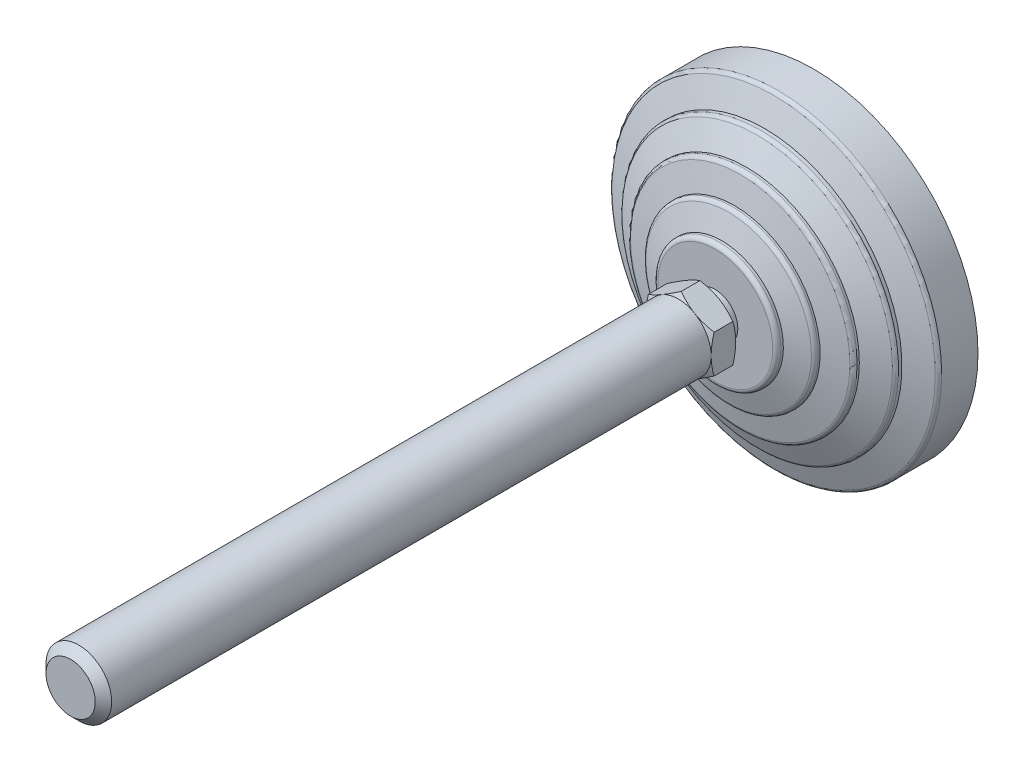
ISO-10303-21;
HEADER;
FILE_DESCRIPTION(('STEP AP214'),'2;1');
FILE_NAME('part.step','',(''),(''),'','','');
FILE_SCHEMA(('AUTOMOTIVE_DESIGN { 1 0 10303 214 1 1 1 1 }'));
ENDSEC;
DATA;
#1=APPLICATION_CONTEXT('core data for automotive mechanical design processes');
#2=APPLICATION_PROTOCOL_DEFINITION('international standard','automotive_design',2000,#1);
#3=PRODUCT_CONTEXT('',#1,'mechanical');
#4=PRODUCT('Part','Part','',(#3));
#5=PRODUCT_RELATED_PRODUCT_CATEGORY('part','',(#4));
#6=PRODUCT_DEFINITION_FORMATION('','',#4);
#7=PRODUCT_DEFINITION_CONTEXT('part definition',#1,'design');
#8=PRODUCT_DEFINITION('design','',#6,#7);
#9=PRODUCT_DEFINITION_SHAPE('','',#8);
#10=(LENGTH_UNIT() NAMED_UNIT(*) SI_UNIT(.MILLI.,.METRE.));
#11=(NAMED_UNIT(*) PLANE_ANGLE_UNIT() SI_UNIT($,.RADIAN.));
#12=(NAMED_UNIT(*) SI_UNIT($,.STERADIAN.) SOLID_ANGLE_UNIT());
#13=UNCERTAINTY_MEASURE_WITH_UNIT(LENGTH_MEASURE(1.E-05),#10,'distance_accuracy_value','');
#14=(GEOMETRIC_REPRESENTATION_CONTEXT(3) GLOBAL_UNCERTAINTY_ASSIGNED_CONTEXT((#13)) GLOBAL_UNIT_ASSIGNED_CONTEXT((#10,
#11,#12)) REPRESENTATION_CONTEXT('',''));
#15=CARTESIAN_POINT('',(0.,0.,0.));
#16=DIRECTION('',(0.,0.,1.));
#17=DIRECTION('',(1.,0.,0.));
#18=AXIS2_PLACEMENT_3D('',#15,#16,#17);
#19=CARTESIAN_POINT('',(-7.76470588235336,0.,27.));
#20=DIRECTION('',(0.,0.,1.));
#21=DIRECTION('',(0.,-1.,0.));
#22=AXIS2_PLACEMENT_3D('',#19,#20,#21);
#23=PLANE('',#22);
#24=CARTESIAN_POINT('',(0.,0.,27.));
#25=DIRECTION('',(0.,0.,-1.));
#26=DIRECTION('',(0.,1.,0.));
#27=AXIS2_PLACEMENT_3D('',#24,#25,#26);
#28=CIRCLE('',#27,5.5000000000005);
#29=CARTESIAN_POINT('',(0.,5.5000000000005,27.));
#30=VERTEX_POINT('',#29);
#31=EDGE_CURVE('E330',#30,#30,#28,.T.);
#32=ORIENTED_EDGE('',*,*,#31,.F.);
#33=EDGE_LOOP('',(#32));
#34=FACE_BOUND('',#33,.T.);
#35=CARTESIAN_POINT('',(0.,0.,27.));
#36=DIRECTION('',(0.,0.,-1.));
#37=DIRECTION('',(-1.,0.,0.));
#38=AXIS2_PLACEMENT_3D('',#35,#36,#37);
#39=CIRCLE('',#38,8.00000000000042);
#40=CARTESIAN_POINT('',(4.,6.92820323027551,27.));
#41=VERTEX_POINT('',#40);
#42=CARTESIAN_POINT('',(8.,0.,27.));
#43=VERTEX_POINT('',#42);
#44=EDGE_CURVE('E477',#41,#43,#39,.T.);
#45=ORIENTED_EDGE('',*,*,#44,.T.);
#46=CARTESIAN_POINT('',(4.,-6.92820323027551,27.));
#47=VERTEX_POINT('',#46);
#48=EDGE_CURVE('E140',#43,#47,#39,.T.);
#49=ORIENTED_EDGE('',*,*,#48,.T.);
#50=CARTESIAN_POINT('',(-4.,-6.92820323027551,27.));
#51=VERTEX_POINT('',#50);
#52=EDGE_CURVE('E139',#47,#51,#39,.T.);
#53=ORIENTED_EDGE('',*,*,#52,.T.);
#54=CARTESIAN_POINT('',(-8.,0.,27.));
#55=VERTEX_POINT('',#54);
#56=EDGE_CURVE('E117',#51,#55,#39,.T.);
#57=ORIENTED_EDGE('',*,*,#56,.T.);
#58=CARTESIAN_POINT('',(-4.,6.92820323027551,27.));
#59=VERTEX_POINT('',#58);
#60=EDGE_CURVE('E105',#55,#59,#39,.T.);
#61=ORIENTED_EDGE('',*,*,#60,.T.);
#62=EDGE_CURVE('E34',#59,#41,#39,.T.);
#63=ORIENTED_EDGE('',*,*,#62,.T.);
#64=EDGE_LOOP('',(#45,#49,#53,#57,#61,#63));
#65=FACE_BOUND('',#64,.T.);
#66=ADVANCED_FACE('F14',(#34,#65),#23,.F.);
#67=CARTESIAN_POINT('',(0.,0.,0.));
#68=DIRECTION('',(0.,0.,-1.));
#69=DIRECTION('',(0.,1.,0.));
#70=AXIS2_PLACEMENT_3D('',#67,#68,#69);
#71=CYLINDRICAL_SURFACE('',#70,5.5000000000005);
#72=CARTESIAN_POINT('',(0.,0.,24.));
#73=DIRECTION('',(0.,0.,-1.));
#74=DIRECTION('',(0.,1.,0.));
#75=AXIS2_PLACEMENT_3D('',#72,#73,#74);
#76=CIRCLE('',#75,5.5000000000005);
#77=CARTESIAN_POINT('',(0.,5.5000000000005,24.));
#78=VERTEX_POINT('',#77);
#79=EDGE_CURVE('E335',#78,#78,#76,.T.);
#80=ORIENTED_EDGE('',*,*,#79,.F.);
#81=EDGE_LOOP('',(#80));
#82=FACE_BOUND('',#81,.T.);
#83=ORIENTED_EDGE('',*,*,#31,.T.);
#84=EDGE_LOOP('',(#83));
#85=FACE_BOUND('',#84,.T.);
#86=ADVANCED_FACE('F297',(#82,#85),#71,.T.);
#87=CARTESIAN_POINT('',(-5.5000000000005,0.,24.));
#88=DIRECTION('',(0.,0.,-1.));
#89=DIRECTION('',(0.,1.,0.));
#90=AXIS2_PLACEMENT_3D('',#87,#88,#89);
#91=PLANE('',#90);
#92=CARTESIAN_POINT('',(0.,0.,24.));
#93=DIRECTION('',(0.,0.,-1.));
#94=DIRECTION('',(0.,1.,0.));
#95=AXIS2_PLACEMENT_3D('',#92,#93,#94);
#96=CIRCLE('',#95,13.9999999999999);
#97=CARTESIAN_POINT('',(0.,13.9999999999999,24.));
#98=VERTEX_POINT('',#97);
#99=EDGE_CURVE('E338',#98,#98,#96,.T.);
#100=ORIENTED_EDGE('',*,*,#99,.F.);
#101=EDGE_LOOP('',(#100));
#102=FACE_BOUND('',#101,.T.);
#103=ORIENTED_EDGE('',*,*,#79,.T.);
#104=EDGE_LOOP('',(#103));
#105=FACE_BOUND('',#104,.T.);
#106=ADVANCED_FACE('F293',(#102,#105),#91,.F.);
#107=CARTESIAN_POINT('',(0.,0.,23.));
#108=DIRECTION('',(0.,0.,-1.));
#109=DIRECTION('',(0.,1.,0.));
#110=AXIS2_PLACEMENT_3D('',#107,#108,#109);
#111=TOROIDAL_SURFACE('',#110,13.9999999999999,1.);
#112=CARTESIAN_POINT('',(0.,0.,23.));
#113=DIRECTION('',(0.,0.,-1.));
#114=DIRECTION('',(0.,1.,0.));
#115=AXIS2_PLACEMENT_3D('',#112,#113,#114);
#116=CIRCLE('',#115,14.9999999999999);
#117=CARTESIAN_POINT('',(0.,14.9999999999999,23.));
#118=VERTEX_POINT('',#117);
#119=EDGE_CURVE('E341',#118,#118,#116,.T.);
#120=ORIENTED_EDGE('',*,*,#119,.F.);
#121=EDGE_LOOP('',(#120));
#122=FACE_BOUND('',#121,.T.);
#123=ORIENTED_EDGE('',*,*,#99,.T.);
#124=EDGE_LOOP('',(#123));
#125=FACE_BOUND('',#124,.T.);
#126=ADVANCED_FACE('F289',(#122,#125),#111,.T.);
#127=CARTESIAN_POINT('',(0.,0.,0.));
#128=DIRECTION('',(0.,0.,-1.));
#129=DIRECTION('',(0.,1.,0.));
#130=AXIS2_PLACEMENT_3D('',#127,#128,#129);
#131=CYLINDRICAL_SURFACE('',#130,14.9999999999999);
#132=CARTESIAN_POINT('',(0.,0.,22.4025287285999));
#133=DIRECTION('',(0.,0.,-1.));
#134=DIRECTION('',(0.,1.,0.));
#135=AXIS2_PLACEMENT_3D('',#132,#133,#134);
#136=CIRCLE('',#135,14.9999999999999);
#137=CARTESIAN_POINT('',(0.,14.9999999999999,22.4025287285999));
#138=VERTEX_POINT('',#137);
#139=EDGE_CURVE('E344',#138,#138,#136,.T.);
#140=ORIENTED_EDGE('',*,*,#139,.F.);
#141=EDGE_LOOP('',(#140));
#142=FACE_BOUND('',#141,.T.);
#143=ORIENTED_EDGE('',*,*,#119,.T.);
#144=EDGE_LOOP('',(#143));
#145=FACE_BOUND('',#144,.T.);
#146=ADVANCED_FACE('F285',(#142,#145),#131,.T.);
#147=CARTESIAN_POINT('',(0.,0.,22.4025287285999));
#148=DIRECTION('',(0.,0.,-1.));
#149=DIRECTION('',(0.,1.,0.));
#150=AXIS2_PLACEMENT_3D('',#147,#148,#149);
#151=CONICAL_SURFACE('',#150,14.9999999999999,1.25589726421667);
#152=CARTESIAN_POINT('',(0.,0.,20.7216684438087));
#153=DIRECTION('',(0.,0.,-1.));
#154=DIRECTION('',(0.,1.,0.));
#155=AXIS2_PLACEMENT_3D('',#152,#153,#154);
#156=CIRCLE('',#155,20.1601635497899);
#157=CARTESIAN_POINT('',(0.,20.1601635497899,20.7216684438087));
#158=VERTEX_POINT('',#157);
#159=EDGE_CURVE('E347',#158,#158,#156,.T.);
#160=ORIENTED_EDGE('',*,*,#159,.F.);
#161=EDGE_LOOP('',(#160));
#162=FACE_BOUND('',#161,.T.);
#163=ORIENTED_EDGE('',*,*,#139,.T.);
#164=EDGE_LOOP('',(#163));
#165=FACE_BOUND('',#164,.T.);
#166=ADVANCED_FACE('F281',(#162,#165),#151,.T.);
#167=CARTESIAN_POINT('',(0.,0.,19.7708407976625));
#168=DIRECTION('',(0.,0.,-1.));
#169=DIRECTION('',(0.,1.,0.));
#170=AXIS2_PLACEMENT_3D('',#167,#168,#169);
#171=TOROIDAL_SURFACE('',#170,19.8504430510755,1.);
#172=CARTESIAN_POINT('',(0.,0.,19.7708407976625));
#173=DIRECTION('',(0.,0.,-1.));
#174=DIRECTION('',(0.,1.,0.));
#175=AXIS2_PLACEMENT_3D('',#172,#173,#174);
#176=CIRCLE('',#175,20.8504430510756);
#177=CARTESIAN_POINT('',(0.,20.8504430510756,19.7708407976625));
#178=VERTEX_POINT('',#177);
#179=EDGE_CURVE('E350',#178,#178,#176,.T.);
#180=ORIENTED_EDGE('',*,*,#179,.F.);
#181=EDGE_LOOP('',(#180));
#182=FACE_BOUND('',#181,.T.);
#183=ORIENTED_EDGE('',*,*,#159,.T.);
#184=EDGE_LOOP('',(#183));
#185=FACE_BOUND('',#184,.T.);
#186=ADVANCED_FACE('F277',(#182,#185),#171,.T.);
#187=CARTESIAN_POINT('',(0.,0.,0.));
#188=DIRECTION('',(0.,0.,-1.));
#189=DIRECTION('',(0.,1.,0.));
#190=AXIS2_PLACEMENT_3D('',#187,#188,#189);
#191=CYLINDRICAL_SURFACE('',#190,20.8504430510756);
#192=CARTESIAN_POINT('',(0.,0.,19.2987385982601));
#193=DIRECTION('',(0.,0.,-1.));
#194=DIRECTION('',(0.,1.,0.));
#195=AXIS2_PLACEMENT_3D('',#192,#193,#194);
#196=CIRCLE('',#195,20.8504430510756);
#197=CARTESIAN_POINT('',(0.,20.8504430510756,19.2987385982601));
#198=VERTEX_POINT('',#197);
#199=EDGE_CURVE('E353',#198,#198,#196,.T.);
#200=ORIENTED_EDGE('',*,*,#199,.F.);
#201=EDGE_LOOP('',(#200));
#202=FACE_BOUND('',#201,.T.);
#203=ORIENTED_EDGE('',*,*,#179,.T.);
#204=EDGE_LOOP('',(#203));
#205=FACE_BOUND('',#204,.T.);
#206=ADVANCED_FACE('F273',(#202,#205),#191,.T.);
#207=CARTESIAN_POINT('',(0.,0.,19.2987385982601));
#208=DIRECTION('',(0.,0.,-1.));
#209=DIRECTION('',(0.,1.,0.));
#210=AXIS2_PLACEMENT_3D('',#207,#208,#209);
#211=CONICAL_SURFACE('',#210,20.8504430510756,1.34067144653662);
#212=CARTESIAN_POINT('',(0.,0.,17.9217501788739));
#213=DIRECTION('',(0.,0.,-1.));
#214=DIRECTION('',(0.,1.,0.));
#215=AXIS2_PLACEMENT_3D('',#212,#213,#214);
#216=CIRCLE('',#215,26.7280991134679);
#217=CARTESIAN_POINT('',(0.,26.7280991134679,17.9217501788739));
#218=VERTEX_POINT('',#217);
#219=EDGE_CURVE('E356',#218,#218,#216,.T.);
#220=ORIENTED_EDGE('',*,*,#219,.F.);
#221=EDGE_LOOP('',(#220));
#222=FACE_BOUND('',#221,.T.);
#223=ORIENTED_EDGE('',*,*,#199,.T.);
#224=EDGE_LOOP('',(#223));
#225=FACE_BOUND('',#224,.T.);
#226=ADVANCED_FACE('F269',(#222,#225),#211,.T.);
#227=CARTESIAN_POINT('',(0.,0.,16.9481122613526));
#228=DIRECTION('',(0.,0.,-1.));
#229=DIRECTION('',(0.,1.,0.));
#230=AXIS2_PLACEMENT_3D('',#227,#228,#229);
#231=TOROIDAL_SURFACE('',#230,26.5,1.);
#232=CARTESIAN_POINT('',(0.,0.,16.9481122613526));
#233=DIRECTION('',(0.,0.,-1.));
#234=DIRECTION('',(0.,1.,0.));
#235=AXIS2_PLACEMENT_3D('',#232,#233,#234);
#236=CIRCLE('',#235,27.5);
#237=CARTESIAN_POINT('',(0.,27.5,16.9481122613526));
#238=VERTEX_POINT('',#237);
#239=EDGE_CURVE('E359',#238,#238,#236,.T.);
#240=ORIENTED_EDGE('',*,*,#239,.F.);
#241=EDGE_LOOP('',(#240));
#242=FACE_BOUND('',#241,.T.);
#243=ORIENTED_EDGE('',*,*,#219,.T.);
#244=EDGE_LOOP('',(#243));
#245=FACE_BOUND('',#244,.T.);
#246=ADVANCED_FACE('F265',(#242,#245),#231,.T.);
#247=CARTESIAN_POINT('',(0.,0.,0.));
#248=DIRECTION('',(0.,0.,-1.));
#249=DIRECTION('',(0.,1.,0.));
#250=AXIS2_PLACEMENT_3D('',#247,#248,#249);
#251=CYLINDRICAL_SURFACE('',#250,27.5);
#252=CARTESIAN_POINT('',(0.,0.,16.4025287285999));
#253=DIRECTION('',(0.,0.,-1.));
#254=DIRECTION('',(0.,1.,0.));
#255=AXIS2_PLACEMENT_3D('',#252,#253,#254);
#256=CIRCLE('',#255,27.5);
#257=CARTESIAN_POINT('',(0.,27.5,16.4025287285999));
#258=VERTEX_POINT('',#257);
#259=EDGE_CURVE('E362',#258,#258,#256,.T.);
#260=ORIENTED_EDGE('',*,*,#259,.F.);
#261=EDGE_LOOP('',(#260));
#262=FACE_BOUND('',#261,.T.);
#263=ORIENTED_EDGE('',*,*,#239,.T.);
#264=EDGE_LOOP('',(#263));
#265=FACE_BOUND('',#264,.T.);
#266=ADVANCED_FACE('F261',(#262,#265),#251,.T.);
#267=CARTESIAN_POINT('',(0.,0.,16.4025287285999));
#268=DIRECTION('',(0.,0.,-1.));
#269=DIRECTION('',(0.,1.,0.));
#270=AXIS2_PLACEMENT_3D('',#267,#268,#269);
#271=CONICAL_SURFACE('',#270,27.5,1.12022914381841);
#272=CARTESIAN_POINT('',(0.,0.,13.7730910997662));
#273=DIRECTION('',(0.,0.,-1.));
#274=DIRECTION('',(0.,1.,0.));
#275=AXIS2_PLACEMENT_3D('',#272,#273,#274);
#276=CIRCLE('',#275,32.935476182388);
#277=CARTESIAN_POINT('',(0.,32.935476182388,13.7730910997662));
#278=VERTEX_POINT('',#277);
#279=EDGE_CURVE('E365',#278,#278,#276,.T.);
#280=ORIENTED_EDGE('',*,*,#279,.F.);
#281=EDGE_LOOP('',(#280));
#282=FACE_BOUND('',#281,.T.);
#283=ORIENTED_EDGE('',*,*,#259,.T.);
#284=EDGE_LOOP('',(#283));
#285=FACE_BOUND('',#284,.T.);
#286=ADVANCED_FACE('F257',(#282,#285),#271,.T.);
#287=CARTESIAN_POINT('',(0.,0.,12.8728908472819));
#288=DIRECTION('',(0.,0.,-1.));
#289=DIRECTION('',(0.,1.,0.));
#290=AXIS2_PLACEMENT_3D('',#287,#288,#289);
#291=TOROIDAL_SURFACE('',#290,32.5,1.);
#292=CARTESIAN_POINT('',(0.,0.,12.8728908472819));
#293=DIRECTION('',(0.,0.,-1.));
#294=DIRECTION('',(0.,1.,0.));
#295=AXIS2_PLACEMENT_3D('',#292,#293,#294);
#296=CIRCLE('',#295,33.5);
#297=CARTESIAN_POINT('',(0.,33.5,12.8728908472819));
#298=VERTEX_POINT('',#297);
#299=EDGE_CURVE('E368',#298,#298,#296,.T.);
#300=ORIENTED_EDGE('',*,*,#299,.F.);
#301=EDGE_LOOP('',(#300));
#302=FACE_BOUND('',#301,.T.);
#303=ORIENTED_EDGE('',*,*,#279,.T.);
#304=EDGE_LOOP('',(#303));
#305=FACE_BOUND('',#304,.T.);
#306=ADVANCED_FACE('F253',(#302,#305),#291,.T.);
#307=CARTESIAN_POINT('',(0.,0.,0.));
#308=DIRECTION('',(0.,0.,-1.));
#309=DIRECTION('',(0.,1.,0.));
#310=AXIS2_PLACEMENT_3D('',#307,#308,#309);
#311=CYLINDRICAL_SURFACE('',#310,33.5);
#312=CARTESIAN_POINT('',(0.,0.,12.0315037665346));
#313=DIRECTION('',(0.,0.,-1.));
#314=DIRECTION('',(0.,1.,0.));
#315=AXIS2_PLACEMENT_3D('',#312,#313,#314);
#316=CIRCLE('',#315,33.5);
#317=CARTESIAN_POINT('',(0.,33.5,12.0315037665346));
#318=VERTEX_POINT('',#317);
#319=EDGE_CURVE('E371',#318,#318,#316,.T.);
#320=ORIENTED_EDGE('',*,*,#319,.F.);
#321=EDGE_LOOP('',(#320));
#322=FACE_BOUND('',#321,.T.);
#323=ORIENTED_EDGE('',*,*,#299,.T.);
#324=EDGE_LOOP('',(#323));
#325=FACE_BOUND('',#324,.T.);
#326=ADVANCED_FACE('F249',(#322,#325),#311,.T.);
#327=CARTESIAN_POINT('',(0.,0.,12.0315037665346));
#328=DIRECTION('',(0.,0.,-1.));
#329=DIRECTION('',(0.,1.,0.));
#330=AXIS2_PLACEMENT_3D('',#327,#328,#329);
#331=CONICAL_SURFACE('',#330,33.5,1.20362249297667);
#332=CARTESIAN_POINT('',(0.,0.,9.77805027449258));
#333=DIRECTION('',(0.,0.,-1.));
#334=DIRECTION('',(0.,1.,0.));
#335=AXIS2_PLACEMENT_3D('',#332,#333,#334);
#336=CIRCLE('',#335,39.3589790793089);
#337=CARTESIAN_POINT('',(0.,39.3589790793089,9.77805027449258));
#338=VERTEX_POINT('',#337);
#339=EDGE_CURVE('E374',#338,#338,#336,.T.);
#340=ORIENTED_EDGE('',*,*,#339,.F.);
#341=EDGE_LOOP('',(#340));
#342=FACE_BOUND('',#341,.T.);
#343=ORIENTED_EDGE('',*,*,#319,.T.);
#344=EDGE_LOOP('',(#343));
#345=FACE_BOUND('',#344,.T.);
#346=ADVANCED_FACE('F245',(#342,#345),#331,.T.);
#347=CARTESIAN_POINT('',(0.,0.,8.84470466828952));
#348=DIRECTION('',(0.,0.,-1.));
#349=DIRECTION('',(0.,1.,0.));
#350=AXIS2_PLACEMENT_3D('',#347,#348,#349);
#351=TOROIDAL_SURFACE('',#350,39.,1.);
#352=CARTESIAN_POINT('',(0.,0.,8.84470466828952));
#353=DIRECTION('',(0.,0.,-1.));
#354=DIRECTION('',(0.,1.,0.));
#355=AXIS2_PLACEMENT_3D('',#352,#353,#354);
#356=CIRCLE('',#355,40.);
#357=CARTESIAN_POINT('',(0.,40.,8.84470466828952));
#358=VERTEX_POINT('',#357);
#359=EDGE_CURVE('E377',#358,#358,#356,.T.);
#360=ORIENTED_EDGE('',*,*,#359,.F.);
#361=EDGE_LOOP('',(#360));
#362=FACE_BOUND('',#361,.T.);
#363=ORIENTED_EDGE('',*,*,#339,.T.);
#364=EDGE_LOOP('',(#363));
#365=FACE_BOUND('',#364,.T.);
#366=ADVANCED_FACE('F241',(#362,#365),#351,.T.);
#367=CARTESIAN_POINT('',(0.,0.,0.));
#368=DIRECTION('',(0.,0.,-1.));
#369=DIRECTION('',(0.,1.,0.));
#370=AXIS2_PLACEMENT_3D('',#367,#368,#369);
#371=CYLINDRICAL_SURFACE('',#370,40.);
#372=CARTESIAN_POINT('',(0.,0.,0.));
#373=DIRECTION('',(0.,0.,-1.));
#374=DIRECTION('',(0.,1.,0.));
#375=AXIS2_PLACEMENT_3D('',#372,#373,#374);
#376=CIRCLE('',#375,40.);
#377=CARTESIAN_POINT('',(0.,40.,0.));
#378=VERTEX_POINT('',#377);
#379=EDGE_CURVE('E380',#378,#378,#376,.T.);
#380=ORIENTED_EDGE('',*,*,#379,.F.);
#381=EDGE_LOOP('',(#380));
#382=FACE_BOUND('',#381,.T.);
#383=ORIENTED_EDGE('',*,*,#359,.T.);
#384=EDGE_LOOP('',(#383));
#385=FACE_BOUND('',#384,.T.);
#386=ADVANCED_FACE('F237',(#382,#385),#371,.T.);
#387=CARTESIAN_POINT('',(0.,0.,0.));
#388=DIRECTION('',(0.,0.,1.));
#389=DIRECTION('',(0.,-1.,0.));
#390=AXIS2_PLACEMENT_3D('',#387,#388,#389);
#391=PLANE('',#390);
#392=ORIENTED_EDGE('',*,*,#379,.T.);
#393=EDGE_LOOP('',(#392));
#394=FACE_BOUND('',#393,.T.);
#395=ADVANCED_FACE('F233',(#394),#391,.F.);
#396=CARTESIAN_POINT('',(0.,0.,28.4344939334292));
#397=DIRECTION('',(0.,0.,1.));
#398=DIRECTION('',(1.,0.,0.));
#399=AXIS2_PLACEMENT_3D('',#396,#397,#398);
#400=CONICAL_SURFACE('',#399,10.4846163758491,1.0471975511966);
#401=CARTESIAN_POINT('',(8.,-12.349886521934,30.8766809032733));
#402=CARTESIAN_POINT('',(8.,-12.0009512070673,30.7076451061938));
#403=CARTESIAN_POINT('',(8.,-11.6512087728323,30.5402465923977));
#404=CARTESIAN_POINT('',(8.,-10.9496802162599,30.2096461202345));
#405=CARTESIAN_POINT('',(8.,-10.5978937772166,30.0464448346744));
#406=CARTESIAN_POINT('',(8.,-9.89000779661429,29.724327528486));
#407=CARTESIAN_POINT('',(8.,-9.53389516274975,29.5654401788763));
#408=CARTESIAN_POINT('',(8.,-8.81881765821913,29.2542438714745));
#409=CARTESIAN_POINT('',(8.,-8.45985292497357,29.1019345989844));
#410=CARTESIAN_POINT('',(8.,-7.7271237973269,28.800960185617));
#411=CARTESIAN_POINT('',(8.,-7.35324949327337,28.6525611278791));
#412=CARTESIAN_POINT('',(8.,-6.601106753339,28.3671325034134));
#413=CARTESIAN_POINT('',(8.,-6.22283782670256,28.2301042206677));
#414=CARTESIAN_POINT('',(8.,-5.46202607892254,27.9710566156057));
#415=CARTESIAN_POINT('',(8.,-5.07949388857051,27.8490064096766));
#416=CARTESIAN_POINT('',(8.,-4.30895666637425,27.6238670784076));
#417=CARTESIAN_POINT('',(8.,-3.92095341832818,27.5207719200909));
#418=CARTESIAN_POINT('',(8.,-3.14133725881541,27.3390812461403));
#419=CARTESIAN_POINT('',(8.,-2.74975574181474,27.2603546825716));
#420=CARTESIAN_POINT('',(8.,-2.15886342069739,27.1639765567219));
#421=CARTESIAN_POINT('',(8.,-1.96129765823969,27.1354678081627));
#422=CARTESIAN_POINT('',(8.,-1.56520356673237,27.0862479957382));
#423=CARTESIAN_POINT('',(8.,-1.36667533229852,27.0655361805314));
#424=CARTESIAN_POINT('',(8.,-0.971490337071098,27.0325796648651));
#425=CARTESIAN_POINT('',(8.,-0.774842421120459,27.0202293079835));
#426=CARTESIAN_POINT('',(8.,-0.381200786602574,27.0038515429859));
#427=CARTESIAN_POINT('',(8.,-0.184207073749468,26.999823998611));
#428=CARTESIAN_POINT('',(8.,0.209774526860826,27.0001877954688));
#429=CARTESIAN_POINT('',(8.,0.406762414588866,27.0045791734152));
#430=CARTESIAN_POINT('',(8.,0.800379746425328,27.0216744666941));
#431=CARTESIAN_POINT('',(8.,0.997009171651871,27.0343788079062));
#432=CARTESIAN_POINT('',(8.,1.47131665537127,27.0747836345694));
#433=CARTESIAN_POINT('',(8.,1.7486575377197,27.1065253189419));
#434=CARTESIAN_POINT('',(8.,2.30123021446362,27.1848015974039));
#435=CARTESIAN_POINT('',(8.,2.57646170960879,27.2313382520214));
#436=CARTESIAN_POINT('',(8.,3.39870676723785,27.3906686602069));
#437=CARTESIAN_POINT('',(8.,3.94195259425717,27.5231522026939));
#438=CARTESIAN_POINT('',(8.,4.75415145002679,27.7522463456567));
#439=CARTESIAN_POINT('',(8.,5.02733381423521,27.8347198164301));
#440=CARTESIAN_POINT('',(8.,5.57104426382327,28.0080732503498));
#441=CARTESIAN_POINT('',(8.,5.84157233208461,28.0989532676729));
#442=CARTESIAN_POINT('',(8.,6.38006215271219,28.2876750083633));
#443=CARTESIAN_POINT('',(8.,6.64802475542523,28.3855143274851));
#444=CARTESIAN_POINT('',(8.,7.18174088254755,28.5870194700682));
#445=CARTESIAN_POINT('',(8.,7.44749442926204,28.6906852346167));
#446=CARTESIAN_POINT('',(8.,8.05954615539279,28.9359340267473));
#447=CARTESIAN_POINT('',(8.,8.40514148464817,29.0792675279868));
#448=CARTESIAN_POINT('',(8.,9.09351092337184,29.3725746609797));
#449=CARTESIAN_POINT('',(8.,9.43628487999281,29.5225486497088));
#450=CARTESIAN_POINT('',(8.,10.1195103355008,29.8278458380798));
#451=CARTESIAN_POINT('',(8.,10.4599614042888,29.9831699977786));
#452=CARTESIAN_POINT('',(8.,11.1388658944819,30.2981318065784));
#453=CARTESIAN_POINT('',(8.,11.4773192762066,30.4577695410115));
#454=CARTESIAN_POINT('',(8.,12.1528711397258,30.780729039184));
#455=CARTESIAN_POINT('',(8.,12.4899679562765,30.944054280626));
#456=CARTESIAN_POINT('',(8.,13.1627313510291,31.2736269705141));
#457=CARTESIAN_POINT('',(8.,13.4983979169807,31.4398744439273));
#458=CARTESIAN_POINT('',(8.,14.5035034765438,31.9422046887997));
#459=CARTESIAN_POINT('',(8.,15.1711296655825,32.2819144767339));
#460=CARTESIAN_POINT('',(8.,16.4494473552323,32.9406883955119));
#461=CARTESIAN_POINT('',(8.,17.0604122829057,33.2592242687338));
#462=CARTESIAN_POINT('',(8.,18.2800477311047,33.9007018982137));
#463=CARTESIAN_POINT('',(8.,18.8887181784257,34.2236437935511));
#464=CARTESIAN_POINT('',(8.,20.102844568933,34.8721443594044));
#465=CARTESIAN_POINT('',(8.,20.708304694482,35.1976952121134));
#466=CARTESIAN_POINT('',(8.,21.9177484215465,35.8514550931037));
#467=CARTESIAN_POINT('',(8.,22.5217320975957,36.1796639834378));
#468=CARTESIAN_POINT('',(8.,23.1251678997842,36.5088703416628));
#469=B_SPLINE_CURVE_WITH_KNOTS('',3,(#401,#402,#403,#404,#405,#406,#407,#408,#409,#410,#411,
#412,#413,#414,#415,#416,#417,#418,#419,#420,#421,#422,#423,#424,#425,#426,#427,#428,#429,#430,
#431,#432,#433,#434,#435,#436,#437,#438,#439,#440,#441,#442,#443,#444,#445,#446,#447,#448,#449,
#450,#451,#452,#453,#454,#455,#456,#457,#458,#459,#460,#461,#462,#463,#464,#465,#466,#467,#468),
.UNSPECIFIED.,.F.,.F.,(4,2,2,2,2,2,2,2,2,2,2,2,2,2,2,2,2,2,2,2,2,2,2,2,2,2,2,2,2,2,2,2,2,4),(0.,
1.16318282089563,2.32655094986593,3.49634919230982,4.66609140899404,5.87269500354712,
7.07943466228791,8.28364275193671,9.48746690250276,10.6846999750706,11.2834065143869,
11.8820553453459,12.4729908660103,13.0639167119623,13.6548451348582,14.2458038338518,
15.0827838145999,15.9198804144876,17.5950286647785,18.4510401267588,19.3070571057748,
20.1627797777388,21.0184937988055,22.1408214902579,23.2632095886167,24.3858001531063,
25.5084129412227,26.6321327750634,27.7558622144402,30.0030502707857,32.0700794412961,
34.1371740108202,36.1994685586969,38.2616567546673),.UNSPECIFIED.);
#470=CARTESIAN_POINT('',(8.,4.61880215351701,27.714531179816));
#471=VERTEX_POINT('',#470);
#472=EDGE_CURVE('E115',#471,#43,#469,.F.);
#473=ORIENTED_EDGE('',*,*,#472,.T.);
#474=ORIENTED_EDGE('',*,*,#44,.F.);
#475=CARTESIAN_POINT('',(-0.00019999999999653,9.23771977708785,27.7145978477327));
#476=CARTESIAN_POINT('',(0.175648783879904,9.13619343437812,27.6559907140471));
#477=CARTESIAN_POINT('',(0.352153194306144,9.03428856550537,27.600043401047));
#478=CARTESIAN_POINT('',(0.70659546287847,8.82965122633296,27.4942010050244));
#479=CARTESIAN_POINT('',(0.884533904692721,8.72691841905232,27.4443085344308));
#480=CARTESIAN_POINT('',(1.42119823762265,8.41707512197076,27.3046927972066));
#481=CARTESIAN_POINT('',(1.78204258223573,8.20874154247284,27.2252811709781));
#482=CARTESIAN_POINT('',(2.32203917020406,7.89697436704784,27.1321616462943));
#483=CARTESIAN_POINT('',(2.49957818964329,7.79447216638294,27.1056345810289));
#484=CARTESIAN_POINT('',(2.85545911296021,7.58900421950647,27.0611531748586));
#485=CARTESIAN_POINT('',(3.03380094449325,7.4860385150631,27.0431980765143));
#486=CARTESIAN_POINT('',(3.3907916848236,7.27992981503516,27.0163156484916));
#487=CARTESIAN_POINT('',(3.56944001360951,7.17678715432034,27.007378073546));
#488=CARTESIAN_POINT('',(3.92690170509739,6.97040655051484,26.9987223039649));
#489=CARTESIAN_POINT('',(4.10571506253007,6.86716861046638,26.9990038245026));
#490=CARTESIAN_POINT('',(4.44001336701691,6.67416139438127,27.0081450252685));
#491=CARTESIAN_POINT('',(4.59552190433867,6.58437849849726,27.0158896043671));
#492=CARTESIAN_POINT('',(4.90617476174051,6.40502298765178,27.0382011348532));
#493=CARTESIAN_POINT('',(5.06131905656,6.31545038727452,27.0527685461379));
#494=CARTESIAN_POINT('',(5.52615131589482,6.04707935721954,27.1063606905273));
#495=CARTESIAN_POINT('',(5.83501648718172,5.86875596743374,27.1552686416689));
#496=CARTESIAN_POINT('',(6.4560232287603,5.51021755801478,27.2775394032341));
#497=CARTESIAN_POINT('',(6.76808554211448,5.3300482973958,27.3514205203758));
#498=CARTESIAN_POINT('',(7.38755648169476,4.97239658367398,27.5191001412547));
#499=CARTESIAN_POINT('',(7.69497304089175,4.79490955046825,27.6128592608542));
#500=CARTESIAN_POINT('',(8.0002,4.61868668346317,27.7145978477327));
#501=B_SPLINE_CURVE_WITH_KNOTS('',3,(#475,#476,#477,#478,#479,#480,#481,#482,#483,#484,#485,
#486,#487,#488,#489,#490,#491,#492,#493,#494,#495,#496,#497,#498,#499,#500),.UNSPECIFIED.,.F.,
.F.,(4,2,2,2,2,2,2,2,2,2,2,2,4),(0.,0.633973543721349,1.26821965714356,2.53934712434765,
3.15934343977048,3.77928496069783,4.39852133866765,5.01773858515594,5.55680239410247,
6.09590254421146,7.17487077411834,8.27776850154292,9.37850115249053),.UNSPECIFIED.);
#502=EDGE_CURVE('E18',#41,#471,#501,.T.);
#503=ORIENTED_EDGE('',*,*,#502,.T.);
#504=EDGE_LOOP('',(#473,#474,#503));
#505=FACE_BOUND('',#504,.T.);
#506=ADVANCED_FACE('F157',(#505),#400,.T.);
#507=CARTESIAN_POINT('',(-8.0002,4.61868668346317,27.7145978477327));
#508=CARTESIAN_POINT('',(-7.82435121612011,4.7202130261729,27.6559907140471));
#509=CARTESIAN_POINT('',(-7.64784680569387,4.82211789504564,27.6000434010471));
#510=CARTESIAN_POINT('',(-7.29340453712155,5.02675523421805,27.4942010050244));
#511=CARTESIAN_POINT('',(-7.11546609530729,5.1294880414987,27.4443085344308));
#512=CARTESIAN_POINT('',(-6.57880176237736,5.43933133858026,27.3046927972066));
#513=CARTESIAN_POINT('',(-6.21795741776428,5.64766491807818,27.2252811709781));
#514=CARTESIAN_POINT('',(-5.67796082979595,5.95943209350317,27.1321616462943));
#515=CARTESIAN_POINT('',(-5.50042181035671,6.06193429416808,27.1056345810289));
#516=CARTESIAN_POINT('',(-5.1445408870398,6.26740224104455,27.0611531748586));
#517=CARTESIAN_POINT('',(-4.96619905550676,6.37036794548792,27.0431980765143));
#518=CARTESIAN_POINT('',(-4.6092083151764,6.57647664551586,27.0163156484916));
#519=CARTESIAN_POINT('',(-4.4305599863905,6.67961930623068,27.007378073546));
#520=CARTESIAN_POINT('',(-4.07309829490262,6.88599991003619,26.9987223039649));
#521=CARTESIAN_POINT('',(-3.89428493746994,6.98923785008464,26.9990038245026));
#522=CARTESIAN_POINT('',(-3.5599866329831,7.18224506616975,27.0081450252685));
#523=CARTESIAN_POINT('',(-3.40447809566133,7.27202796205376,27.0158896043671));
#524=CARTESIAN_POINT('',(-3.09382523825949,7.45138347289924,27.0382011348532));
#525=CARTESIAN_POINT('',(-2.93868094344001,7.5409560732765,27.0527685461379));
#526=CARTESIAN_POINT('',(-2.47384868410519,7.80932710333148,27.1063606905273));
#527=CARTESIAN_POINT('',(-2.16498351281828,7.98765049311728,27.1552686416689));
#528=CARTESIAN_POINT('',(-1.5439767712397,8.34618890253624,27.2775394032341));
#529=CARTESIAN_POINT('',(-1.23191445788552,8.52635816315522,27.3514205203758));
#530=CARTESIAN_POINT('',(-0.612443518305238,8.88400987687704,27.5191001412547));
#531=CARTESIAN_POINT('',(-0.305026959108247,9.06149691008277,27.6128592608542));
#532=CARTESIAN_POINT('',(0.000200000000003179,9.23771977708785,27.7145978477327));
#533=B_SPLINE_CURVE_WITH_KNOTS('',3,(#507,#508,#509,#510,#511,#512,#513,#514,#515,#516,#517,
#518,#519,#520,#521,#522,#523,#524,#525,#526,#527,#528,#529,#530,#531,#532),.UNSPECIFIED.,.F.,
.F.,(4,2,2,2,2,2,2,2,2,2,2,2,4),(0.,0.633973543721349,1.26821965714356,2.53934712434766,
3.15934343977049,3.77928496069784,4.39852133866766,5.01773858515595,5.55680239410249,
6.09590254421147,7.17487077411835,8.27776850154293,9.37850115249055),.UNSPECIFIED.);
#534=CARTESIAN_POINT('',(0.,9.23760430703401,27.714531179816));
#535=VERTEX_POINT('',#534);
#536=EDGE_CURVE('E149',#59,#535,#533,.T.);
#537=ORIENTED_EDGE('',*,*,#536,.T.);
#538=EDGE_CURVE('E9',#535,#41,#501,.T.);
#539=ORIENTED_EDGE('',*,*,#538,.T.);
#540=ORIENTED_EDGE('',*,*,#62,.F.);
#541=EDGE_LOOP('',(#537,#539,#540));
#542=FACE_BOUND('',#541,.T.);
#543=ADVANCED_FACE('F470',(#542),#400,.T.);
#544=CARTESIAN_POINT('',(8.0002,-4.61868668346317,27.7145978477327));
#545=CARTESIAN_POINT('',(7.82435121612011,-4.7202130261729,27.6559907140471));
#546=CARTESIAN_POINT('',(7.64784680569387,-4.82211789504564,27.6000434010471));
#547=CARTESIAN_POINT('',(7.29340453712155,-5.02675523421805,27.4942010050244));
#548=CARTESIAN_POINT('',(7.11546609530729,-5.1294880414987,27.4443085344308));
#549=CARTESIAN_POINT('',(6.57880176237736,-5.43933133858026,27.3046927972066));
#550=CARTESIAN_POINT('',(6.21795741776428,-5.64766491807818,27.2252811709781));
#551=CARTESIAN_POINT('',(5.67796082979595,-5.95943209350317,27.1321616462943));
#552=CARTESIAN_POINT('',(5.50042181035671,-6.06193429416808,27.1056345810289));
#553=CARTESIAN_POINT('',(5.1445408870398,-6.26740224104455,27.0611531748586));
#554=CARTESIAN_POINT('',(4.96619905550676,-6.37036794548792,27.0431980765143));
#555=CARTESIAN_POINT('',(4.6092083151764,-6.57647664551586,27.0163156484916));
#556=CARTESIAN_POINT('',(4.4305599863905,-6.67961930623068,27.007378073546));
#557=CARTESIAN_POINT('',(4.07309829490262,-6.88599991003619,26.9987223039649));
#558=CARTESIAN_POINT('',(3.89428493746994,-6.98923785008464,26.9990038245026));
#559=CARTESIAN_POINT('',(3.5599866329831,-7.18224506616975,27.0081450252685));
#560=CARTESIAN_POINT('',(3.40447809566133,-7.27202796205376,27.0158896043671));
#561=CARTESIAN_POINT('',(3.09382523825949,-7.45138347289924,27.0382011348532));
#562=CARTESIAN_POINT('',(2.93868094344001,-7.5409560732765,27.0527685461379));
#563=CARTESIAN_POINT('',(2.47384868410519,-7.80932710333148,27.1063606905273));
#564=CARTESIAN_POINT('',(2.16498351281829,-7.98765049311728,27.1552686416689));
#565=CARTESIAN_POINT('',(1.5439767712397,-8.34618890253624,27.2775394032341));
#566=CARTESIAN_POINT('',(1.23191445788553,-8.52635816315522,27.3514205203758));
#567=CARTESIAN_POINT('',(0.612443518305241,-8.88400987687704,27.5191001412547));
#568=CARTESIAN_POINT('',(0.305026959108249,-9.06149691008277,27.6128592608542));
#569=CARTESIAN_POINT('',(-0.000200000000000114,-9.23771977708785,27.7145978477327));
#570=B_SPLINE_CURVE_WITH_KNOTS('',3,(#544,#545,#546,#547,#548,#549,#550,#551,#552,#553,#554,
#555,#556,#557,#558,#559,#560,#561,#562,#563,#564,#565,#566,#567,#568,#569),.UNSPECIFIED.,.F.,
.F.,(4,2,2,2,2,2,2,2,2,2,2,2,4),(0.,0.633973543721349,1.26821965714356,2.53934712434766,
3.15934343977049,3.77928496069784,4.39852133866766,5.01773858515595,5.55680239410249,
6.09590254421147,7.17487077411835,8.27776850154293,9.37850115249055),.UNSPECIFIED.);
#571=CARTESIAN_POINT('',(8.,-4.61880215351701,27.714531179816));
#572=VERTEX_POINT('',#571);
#573=EDGE_CURVE('E135',#572,#47,#570,.T.);
#574=ORIENTED_EDGE('',*,*,#573,.T.);
#575=ORIENTED_EDGE('',*,*,#48,.F.);
#576=EDGE_CURVE('E150',#43,#572,#469,.F.);
#577=ORIENTED_EDGE('',*,*,#576,.T.);
#578=EDGE_LOOP('',(#574,#575,#577));
#579=FACE_BOUND('',#578,.T.);
#580=ADVANCED_FACE('F464',(#579),#400,.T.);
#581=CARTESIAN_POINT('',(0.000200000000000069,-9.23771977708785,27.7145978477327));
#582=CARTESIAN_POINT('',(-0.175648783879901,-9.13619343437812,27.655990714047));
#583=CARTESIAN_POINT('',(-0.352153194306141,-9.03428856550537,27.600043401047));
#584=CARTESIAN_POINT('',(-0.706595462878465,-8.82965122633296,27.4942010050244));
#585=CARTESIAN_POINT('',(-0.884533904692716,-8.72691841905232,27.4443085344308));
#586=CARTESIAN_POINT('',(-1.42119823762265,-8.41707512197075,27.3046927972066));
#587=CARTESIAN_POINT('',(-1.78204258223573,-8.20874154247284,27.2252811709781));
#588=CARTESIAN_POINT('',(-2.32203917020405,-7.89697436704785,27.1321616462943));
#589=CARTESIAN_POINT('',(-2.49957818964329,-7.79447216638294,27.1056345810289));
#590=CARTESIAN_POINT('',(-2.8554591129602,-7.58900421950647,27.0611531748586));
#591=CARTESIAN_POINT('',(-3.03380094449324,-7.4860385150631,27.0431980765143));
#592=CARTESIAN_POINT('',(-3.3907916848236,-7.27992981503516,27.0163156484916));
#593=CARTESIAN_POINT('',(-3.5694400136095,-7.17678715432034,27.007378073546));
#594=CARTESIAN_POINT('',(-3.92690170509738,-6.97040655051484,26.9987223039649));
#595=CARTESIAN_POINT('',(-4.10571506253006,-6.86716861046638,26.9990038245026));
#596=CARTESIAN_POINT('',(-4.4400133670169,-6.67416139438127,27.0081450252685));
#597=CARTESIAN_POINT('',(-4.59552190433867,-6.58437849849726,27.0158896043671));
#598=CARTESIAN_POINT('',(-4.90617476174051,-6.40502298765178,27.0382011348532));
#599=CARTESIAN_POINT('',(-5.06131905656,-6.31545038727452,27.0527685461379));
#600=CARTESIAN_POINT('',(-5.52615131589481,-6.04707935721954,27.1063606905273));
#601=CARTESIAN_POINT('',(-5.83501648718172,-5.86875596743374,27.1552686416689));
#602=CARTESIAN_POINT('',(-6.4560232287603,-5.51021755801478,27.2775394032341));
#603=CARTESIAN_POINT('',(-6.76808554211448,-5.3300482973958,27.3514205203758));
#604=CARTESIAN_POINT('',(-7.38755648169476,-4.97239658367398,27.5191001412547));
#605=CARTESIAN_POINT('',(-7.69497304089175,-4.79490955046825,27.6128592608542));
#606=CARTESIAN_POINT('',(-8.0002,-4.61868668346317,27.7145978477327));
#607=B_SPLINE_CURVE_WITH_KNOTS('',3,(#581,#582,#583,#584,#585,#586,#587,#588,#589,#590,#591,
#592,#593,#594,#595,#596,#597,#598,#599,#600,#601,#602,#603,#604,#605,#606),.UNSPECIFIED.,.F.,
.F.,(4,2,2,2,2,2,2,2,2,2,2,2,4),(0.,0.633973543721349,1.26821965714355,2.53934712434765,
3.15934343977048,3.77928496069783,4.39852133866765,5.01773858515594,5.55680239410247,
6.09590254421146,7.17487077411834,8.27776850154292,9.37850115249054),.UNSPECIFIED.);
#608=CARTESIAN_POINT('',(0.,-9.23760430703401,27.714531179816));
#609=VERTEX_POINT('',#608);
#610=EDGE_CURVE('E415',#609,#51,#607,.T.);
#611=ORIENTED_EDGE('',*,*,#610,.T.);
#612=ORIENTED_EDGE('',*,*,#52,.F.);
#613=EDGE_CURVE('E128',#47,#609,#570,.T.);
#614=ORIENTED_EDGE('',*,*,#613,.T.);
#615=EDGE_LOOP('',(#611,#612,#614));
#616=FACE_BOUND('',#615,.T.);
#617=ADVANCED_FACE('F458',(#616),#400,.T.);
#618=CARTESIAN_POINT('',(-8.,-4.618802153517,27.714531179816));
#619=VERTEX_POINT('',#618);
#620=EDGE_CURVE('E124',#51,#619,#607,.T.);
#621=ORIENTED_EDGE('',*,*,#620,.T.);
#622=CARTESIAN_POINT('',(-8.,-12.3498865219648,30.8766809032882));
#623=CARTESIAN_POINT('',(-8.,-12.0009512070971,30.7076451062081));
#624=CARTESIAN_POINT('',(-8.,-11.6512087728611,30.5402465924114));
#625=CARTESIAN_POINT('',(-8.,-10.9496802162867,30.209646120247));
#626=CARTESIAN_POINT('',(-8.,-10.5978937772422,30.0464448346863));
#627=CARTESIAN_POINT('',(-8.,-9.89000779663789,29.7243275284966));
#628=CARTESIAN_POINT('',(-8.,-9.53389516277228,29.5654401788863));
#629=CARTESIAN_POINT('',(-8.,-8.81881765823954,29.2542438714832));
#630=CARTESIAN_POINT('',(-8.,-8.45985292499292,29.1019345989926));
#631=CARTESIAN_POINT('',(-8.,-7.72712379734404,28.8009601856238));
#632=CARTESIAN_POINT('',(-8.,-7.35324949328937,28.6525611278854));
#633=CARTESIAN_POINT('',(-8.,-6.6011067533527,28.3671325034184));
#634=CARTESIAN_POINT('',(-8.,-6.2228378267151,28.2301042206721));
#635=CARTESIAN_POINT('',(-8.,-5.46202607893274,27.971056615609));
#636=CARTESIAN_POINT('',(-8.,-5.07949388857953,27.8490064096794));
#637=CARTESIAN_POINT('',(-8.,-4.30895666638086,27.6238670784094));
#638=CARTESIAN_POINT('',(-8.,-3.92095341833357,27.5207719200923));
#639=CARTESIAN_POINT('',(-8.,-3.14133725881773,27.3390812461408));
#640=CARTESIAN_POINT('',(-8.,-2.7497557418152,27.2603546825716));
#641=CARTESIAN_POINT('',(-8.,-2.15886342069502,27.1639765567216));
#642=CARTESIAN_POINT('',(-8.,-1.96129765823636,27.1354678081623));
#643=CARTESIAN_POINT('',(-8.,-1.56520356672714,27.0862479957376));
#644=CARTESIAN_POINT('',(-8.,-1.36667533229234,27.0655361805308));
#645=CARTESIAN_POINT('',(-8.,-0.971490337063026,27.0325796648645));
#646=CARTESIAN_POINT('',(-8.,-0.774842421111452,27.020229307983));
#647=CARTESIAN_POINT('',(-8.,-0.381200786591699,27.0038515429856));
#648=CARTESIAN_POINT('',(-8.,-0.184207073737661,26.9998239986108));
#649=CARTESIAN_POINT('',(-8.,0.209774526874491,27.000187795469));
#650=CARTESIAN_POINT('',(-8.,0.406762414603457,27.0045791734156));
#651=CARTESIAN_POINT('',(-8.,0.800379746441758,27.021674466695));
#652=CARTESIAN_POINT('',(-8.,0.997009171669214,27.0343788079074));
#653=CARTESIAN_POINT('',(-8.,1.47131665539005,27.0747836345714));
#654=CARTESIAN_POINT('',(-8.,1.748657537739,27.1065253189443));
#655=CARTESIAN_POINT('',(-8.,2.30123021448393,27.1848015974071));
#656=CARTESIAN_POINT('',(-8.,2.57646170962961,27.231338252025));
#657=CARTESIAN_POINT('',(-8.,3.39870676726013,27.3906686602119));
#658=CARTESIAN_POINT('',(-8.,3.94195259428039,27.5231522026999));
#659=CARTESIAN_POINT('',(-8.,4.75415145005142,27.752246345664));
#660=CARTESIAN_POINT('',(-8.,5.02733381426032,27.8347198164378));
#661=CARTESIAN_POINT('',(-8.,5.57104426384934,28.0080732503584));
#662=CARTESIAN_POINT('',(-8.,5.84157233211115,28.098953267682));
#663=CARTESIAN_POINT('',(-8.,6.38006215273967,28.2876750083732));
#664=CARTESIAN_POINT('',(-8.,6.64802475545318,28.3855143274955));
#665=CARTESIAN_POINT('',(-8.,7.18174088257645,28.5870194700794));
#666=CARTESIAN_POINT('',(-8.,7.4474944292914,28.6906852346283));
#667=CARTESIAN_POINT('',(-8.,8.0595461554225,28.9359340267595));
#668=CARTESIAN_POINT('',(-8.,8.40514148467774,29.0792675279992));
#669=CARTESIAN_POINT('',(-8.,9.09351092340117,29.3725746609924));
#670=CARTESIAN_POINT('',(-8.,9.43628488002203,29.5225486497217));
#671=CARTESIAN_POINT('',(-8.,10.1195103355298,29.8278458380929));
#672=CARTESIAN_POINT('',(-8.,10.4599614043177,29.9831699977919));
#673=CARTESIAN_POINT('',(-8.,11.1388658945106,30.2981318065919));
#674=CARTESIAN_POINT('',(-8.,11.4773192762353,30.4577695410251));
#675=CARTESIAN_POINT('',(-8.,12.1528711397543,30.7807290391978));
#676=CARTESIAN_POINT('',(-8.,12.4899679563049,30.9440542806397));
#677=CARTESIAN_POINT('',(-8.,13.1627313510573,31.273626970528));
#678=CARTESIAN_POINT('',(-8.,13.4983979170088,31.4398744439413));
#679=CARTESIAN_POINT('',(-8.,14.5035034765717,31.9422046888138));
#680=CARTESIAN_POINT('',(-8.,15.1711296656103,32.2819144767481));
#681=CARTESIAN_POINT('',(-8.,16.4494473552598,32.9406883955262));
#682=CARTESIAN_POINT('',(-8.,17.0604122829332,33.2592242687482));
#683=CARTESIAN_POINT('',(-8.,18.2800477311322,33.9007018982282));
#684=CARTESIAN_POINT('',(-7.99999999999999,18.8887181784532,34.2236437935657));
#685=CARTESIAN_POINT('',(-7.99999999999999,20.1028445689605,34.8721443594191));
#686=CARTESIAN_POINT('',(-7.99999999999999,20.7083046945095,35.1976952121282));
#687=CARTESIAN_POINT('',(-7.99999999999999,21.917748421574,35.8514550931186));
#688=CARTESIAN_POINT('',(-8.,22.5217320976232,36.1796639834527));
#689=CARTESIAN_POINT('',(-8.,23.1251678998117,36.5088703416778));
#690=B_SPLINE_CURVE_WITH_KNOTS('',3,(#622,#623,#624,#625,#626,#627,#628,#629,#630,#631,#632,
#633,#634,#635,#636,#637,#638,#639,#640,#641,#642,#643,#644,#645,#646,#647,#648,#649,#650,#651,
#652,#653,#654,#655,#656,#657,#658,#659,#660,#661,#662,#663,#664,#665,#666,#667,#668,#669,#670,
#671,#672,#673,#674,#675,#676,#677,#678,#679,#680,#681,#682,#683,#684,#685,#686,#687,#688,#689),
.UNSPECIFIED.,.F.,.F.,(4,2,2,2,2,2,2,2,2,2,2,2,2,2,2,2,2,2,2,2,2,2,2,2,2,2,2,2,2,2,2,2,2,4),(0.,
1.16318282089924,2.32655094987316,3.49634919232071,4.66609140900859,5.87269500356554,
7.07943466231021,8.28364275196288,9.48746690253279,10.6846999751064,11.2834065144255,
11.8820553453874,12.4729908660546,13.0639167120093,13.654845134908,14.2458038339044,
15.0827838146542,15.9198804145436,17.5950286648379,18.45104012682,19.3070571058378,
20.1627797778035,21.0184937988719,22.1408214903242,23.2632095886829,24.3858001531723,
25.5084129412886,26.6321327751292,27.7558622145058,30.0030502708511,32.0700794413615,
34.1371740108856,36.1994685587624,38.2616567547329),.UNSPECIFIED.);
#691=EDGE_CURVE('E120',#619,#55,#690,.T.);
#692=ORIENTED_EDGE('',*,*,#691,.T.);
#693=ORIENTED_EDGE('',*,*,#56,.F.);
#694=EDGE_LOOP('',(#621,#692,#693));
#695=FACE_BOUND('',#694,.T.);
#696=ADVANCED_FACE('F121',(#695),#400,.T.);
#697=CARTESIAN_POINT('',(-8.,4.61880215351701,27.714531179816));
#698=VERTEX_POINT('',#697);
#699=EDGE_CURVE('E109',#55,#698,#690,.T.);
#700=ORIENTED_EDGE('',*,*,#699,.T.);
#701=EDGE_CURVE('E111',#698,#59,#533,.T.);
#702=ORIENTED_EDGE('',*,*,#701,.T.);
#703=ORIENTED_EDGE('',*,*,#60,.F.);
#704=EDGE_LOOP('',(#700,#702,#703));
#705=FACE_BOUND('',#704,.T.);
#706=ADVANCED_FACE('F107',(#705),#400,.T.);
#707=CARTESIAN_POINT('',(-6.00000000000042,0.,181.));
#708=DIRECTION('',(0.,0.,-1.));
#709=DIRECTION('',(0.,1.,0.));
#710=AXIS2_PLACEMENT_3D('',#707,#708,#709);
#711=PLANE('',#710);
#712=CARTESIAN_POINT('',(0.,0.,181.));
#713=DIRECTION('',(0.,0.,-1.));
#714=DIRECTION('',(0.,1.,0.));
#715=AXIS2_PLACEMENT_3D('',#712,#713,#714);
#716=CIRCLE('',#715,6.00000000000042);
#717=CARTESIAN_POINT('',(0.,6.00000000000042,181.));
#718=VERTEX_POINT('',#717);
#719=EDGE_CURVE('E324',#718,#718,#716,.T.);
#720=ORIENTED_EDGE('',*,*,#719,.F.);
#721=EDGE_LOOP('',(#720));
#722=FACE_BOUND('',#721,.T.);
#723=ADVANCED_FACE('F16',(#722),#711,.F.);
#724=CARTESIAN_POINT('',(0.,0.,181.));
#725=DIRECTION('',(0.,0.,-1.));
#726=DIRECTION('',(0.,1.,0.));
#727=AXIS2_PLACEMENT_3D('',#724,#725,#726);
#728=CONICAL_SURFACE('',#727,6.00000000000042,0.785398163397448);
#729=CARTESIAN_POINT('',(0.,0.,179.));
#730=DIRECTION('',(0.,0.,-1.));
#731=DIRECTION('',(0.,1.,0.));
#732=AXIS2_PLACEMENT_3D('',#729,#730,#731);
#733=CIRCLE('',#732,8.00000000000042);
#734=CARTESIAN_POINT('',(0.,8.00000000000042,179.));
#735=VERTEX_POINT('',#734);
#736=EDGE_CURVE('E321',#735,#735,#733,.T.);
#737=ORIENTED_EDGE('',*,*,#736,.F.);
#738=EDGE_LOOP('',(#737));
#739=FACE_BOUND('',#738,.T.);
#740=ORIENTED_EDGE('',*,*,#719,.T.);
#741=EDGE_LOOP('',(#740));
#742=FACE_BOUND('',#741,.T.);
#743=ADVANCED_FACE('F308',(#739,#742),#728,.T.);
#744=CARTESIAN_POINT('',(0.,0.,0.));
#745=DIRECTION('',(0.,0.,-1.));
#746=DIRECTION('',(0.,1.,0.));
#747=AXIS2_PLACEMENT_3D('',#744,#745,#746);
#748=CYLINDRICAL_SURFACE('',#747,8.00000000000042);
#749=ORIENTED_EDGE('',*,*,#736,.T.);
#750=EDGE_LOOP('',(#749));
#751=FACE_BOUND('',#750,.T.);
#752=CARTESIAN_POINT('',(0.,0.,33.));
#753=DIRECTION('',(0.,0.,-1.));
#754=DIRECTION('',(0.,1.,0.));
#755=AXIS2_PLACEMENT_3D('',#752,#753,#754);
#756=CIRCLE('',#755,8.00000000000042);
#757=CARTESIAN_POINT('',(4.,6.92820323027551,33.));
#758=VERTEX_POINT('',#757);
#759=CARTESIAN_POINT('',(8.00000000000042,0.,33.));
#760=VERTEX_POINT('',#759);
#761=EDGE_CURVE('E329',#758,#760,#756,.T.);
#762=ORIENTED_EDGE('',*,*,#761,.F.);
#763=CARTESIAN_POINT('',(-4.00000000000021,6.92820323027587,33.));
#764=VERTEX_POINT('',#763);
#765=EDGE_CURVE('E325',#764,#758,#756,.T.);
#766=ORIENTED_EDGE('',*,*,#765,.F.);
#767=CARTESIAN_POINT('',(0.,0.,33.));
#768=DIRECTION('',(0.,0.,-1.));
#769=DIRECTION('',(-1.,0.,0.));
#770=AXIS2_PLACEMENT_3D('',#767,#768,#769);
#771=CIRCLE('',#770,8.00000000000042);
#772=CARTESIAN_POINT('',(-8.00000000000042,0.,33.));
#773=VERTEX_POINT('',#772);
#774=EDGE_CURVE('E412',#773,#764,#771,.T.);
#775=ORIENTED_EDGE('',*,*,#774,.F.);
#776=CARTESIAN_POINT('',(-4.00000000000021,-6.92820323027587,33.));
#777=VERTEX_POINT('',#776);
#778=EDGE_CURVE('E328',#777,#773,#756,.T.);
#779=ORIENTED_EDGE('',*,*,#778,.F.);
#780=CARTESIAN_POINT('',(4.00000000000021,-6.92820323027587,33.));
#781=VERTEX_POINT('',#780);
#782=EDGE_CURVE('E409',#781,#777,#756,.T.);
#783=ORIENTED_EDGE('',*,*,#782,.F.);
#784=EDGE_CURVE('E486',#760,#781,#756,.T.);
#785=ORIENTED_EDGE('',*,*,#784,.F.);
#786=EDGE_LOOP('',(#762,#766,#775,#779,#783,#785));
#787=FACE_BOUND('',#786,.T.);
#788=ADVANCED_FACE('F305',(#751,#787),#748,.T.);
#789=CARTESIAN_POINT('',(0.,0.,33.));
#790=DIRECTION('',(0.,0.,-1.));
#791=DIRECTION('',(-1.,0.,0.));
#792=AXIS2_PLACEMENT_3D('',#789,#790,#791);
#793=CONICAL_SURFACE('',#792,8.00000000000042,1.0471975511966);
#794=CARTESIAN_POINT('',(0.000200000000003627,9.23771977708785,32.2854021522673));
#795=CARTESIAN_POINT('',(-0.175648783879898,9.13619343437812,32.344009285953));
#796=CARTESIAN_POINT('',(-0.352153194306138,9.03428856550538,32.399956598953));
#797=CARTESIAN_POINT('',(-0.706595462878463,8.82965122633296,32.5057989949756));
#798=CARTESIAN_POINT('',(-0.884533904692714,8.72691841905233,32.5556914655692));
#799=CARTESIAN_POINT('',(-1.42119823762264,8.41707512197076,32.6953072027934));
#800=CARTESIAN_POINT('',(-1.78204258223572,8.20874154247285,32.7747188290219));
#801=CARTESIAN_POINT('',(-2.32203917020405,7.89697436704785,32.8678383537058));
#802=CARTESIAN_POINT('',(-2.49957818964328,7.79447216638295,32.8943654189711));
#803=CARTESIAN_POINT('',(-2.8554591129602,7.58900421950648,32.9388468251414));
#804=CARTESIAN_POINT('',(-3.03380094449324,7.4860385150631,32.9568019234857));
#805=CARTESIAN_POINT('',(-3.39079168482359,7.27992981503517,32.9836843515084));
#806=CARTESIAN_POINT('',(-3.5694400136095,7.17678715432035,32.992621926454));
#807=CARTESIAN_POINT('',(-3.92690170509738,6.97040655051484,33.0012776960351));
#808=CARTESIAN_POINT('',(-4.10571506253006,6.86716861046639,33.0009961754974));
#809=CARTESIAN_POINT('',(-4.4400133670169,6.67416139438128,32.9918549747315));
#810=CARTESIAN_POINT('',(-4.59552190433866,6.58437849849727,32.9841103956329));
#811=CARTESIAN_POINT('',(-4.9061747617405,6.40502298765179,32.9617988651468));
#812=CARTESIAN_POINT('',(-5.06131905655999,6.31545038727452,32.9472314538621));
#813=CARTESIAN_POINT('',(-5.52615131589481,6.04707935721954,32.8936393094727));
#814=CARTESIAN_POINT('',(-5.83501648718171,5.86875596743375,32.8447313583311));
#815=CARTESIAN_POINT('',(-6.45602322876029,5.51021755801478,32.7224605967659));
#816=CARTESIAN_POINT('',(-6.76808554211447,5.33004829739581,32.6485794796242));
#817=CARTESIAN_POINT('',(-7.38755648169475,4.97239658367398,32.4808998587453));
#818=CARTESIAN_POINT('',(-7.69497304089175,4.79490955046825,32.3871407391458));
#819=CARTESIAN_POINT('',(-8.0002,4.61868668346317,32.2854021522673));
#820=B_SPLINE_CURVE_WITH_KNOTS('',3,(#794,#795,#796,#797,#798,#799,#800,#801,#802,#803,#804,
#805,#806,#807,#808,#809,#810,#811,#812,#813,#814,#815,#816,#817,#818,#819),.UNSPECIFIED.,.F.,
.F.,(4,2,2,2,2,2,2,2,2,2,2,2,4),(0.,0.633973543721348,1.26821965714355,2.53934712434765,
3.15934343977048,3.77928496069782,4.39852133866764,5.01773858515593,5.55680239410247,
6.09590254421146,7.17487077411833,8.27776850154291,9.37850115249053),.UNSPECIFIED.);
#821=CARTESIAN_POINT('',(-8.,4.61880215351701,32.285468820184));
#822=VERTEX_POINT('',#821);
#823=EDGE_CURVE('E220',#764,#822,#820,.T.);
#824=ORIENTED_EDGE('',*,*,#823,.T.);
#825=CARTESIAN_POINT('',(-8.,-12.3498865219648,29.1233190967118));
#826=CARTESIAN_POINT('',(-8.,-12.0009512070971,29.2923548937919));
#827=CARTESIAN_POINT('',(-8.,-11.6512087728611,29.4597534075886));
#828=CARTESIAN_POINT('',(-8.,-10.9496802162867,29.790353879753));
#829=CARTESIAN_POINT('',(-8.,-10.5978937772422,29.9535551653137));
#830=CARTESIAN_POINT('',(-8.,-9.89000779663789,30.2756724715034));
#831=CARTESIAN_POINT('',(-8.,-9.53389516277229,30.4345598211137));
#832=CARTESIAN_POINT('',(-8.,-8.81881765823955,30.7457561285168));
#833=CARTESIAN_POINT('',(-8.,-8.45985292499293,30.8980654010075));
#834=CARTESIAN_POINT('',(-8.,-7.72712379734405,31.1990398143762));
#835=CARTESIAN_POINT('',(-8.,-7.35324949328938,31.3474388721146));
#836=CARTESIAN_POINT('',(-8.,-6.6011067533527,31.6328674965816));
#837=CARTESIAN_POINT('',(-8.,-6.2228378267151,31.7698957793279));
#838=CARTESIAN_POINT('',(-8.,-5.46202607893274,32.028943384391));
#839=CARTESIAN_POINT('',(-8.,-5.07949388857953,32.1509935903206));
#840=CARTESIAN_POINT('',(-8.,-4.30895666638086,32.3761329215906));
#841=CARTESIAN_POINT('',(-8.,-3.92095341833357,32.4792280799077));
#842=CARTESIAN_POINT('',(-8.,-3.14133725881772,32.6609187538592));
#843=CARTESIAN_POINT('',(-8.,-2.7497557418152,32.7396453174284));
#844=CARTESIAN_POINT('',(-8.,-2.15886342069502,32.8360234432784));
#845=CARTESIAN_POINT('',(-8.,-1.96129765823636,32.8645321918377));
#846=CARTESIAN_POINT('',(-8.,-1.56520356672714,32.9137520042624));
#847=CARTESIAN_POINT('',(-8.,-1.36667533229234,32.9344638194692));
#848=CARTESIAN_POINT('',(-8.,-0.971490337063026,32.9674203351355));
#849=CARTESIAN_POINT('',(-8.,-0.774842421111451,32.979770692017));
#850=CARTESIAN_POINT('',(-8.,-0.381200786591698,32.9961484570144));
#851=CARTESIAN_POINT('',(-8.,-0.18420707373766,33.0001760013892));
#852=CARTESIAN_POINT('',(-8.,0.209774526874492,32.999812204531));
#853=CARTESIAN_POINT('',(-8.,0.406762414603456,32.9954208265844));
#854=CARTESIAN_POINT('',(-8.,0.800379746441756,32.978325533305));
#855=CARTESIAN_POINT('',(-8.,0.997009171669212,32.9656211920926));
#856=CARTESIAN_POINT('',(-8.,1.47131665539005,32.9252163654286));
#857=CARTESIAN_POINT('',(-8.,1.748657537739,32.8934746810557));
#858=CARTESIAN_POINT('',(-8.,2.30123021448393,32.8151984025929));
#859=CARTESIAN_POINT('',(-8.,2.57646170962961,32.768661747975));
#860=CARTESIAN_POINT('',(-8.,3.39870676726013,32.6093313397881));
#861=CARTESIAN_POINT('',(-8.,3.94195259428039,32.4768477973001));
#862=CARTESIAN_POINT('',(-8.,4.75415145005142,32.247753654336));
#863=CARTESIAN_POINT('',(-8.,5.02733381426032,32.1652801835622));
#864=CARTESIAN_POINT('',(-8.,5.57104426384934,31.9919267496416));
#865=CARTESIAN_POINT('',(-8.,5.84157233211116,31.901046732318));
#866=CARTESIAN_POINT('',(-8.,6.38006215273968,31.7123249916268));
#867=CARTESIAN_POINT('',(-8.,6.6480247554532,31.6144856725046));
#868=CARTESIAN_POINT('',(-8.,7.18174088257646,31.4129805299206));
#869=CARTESIAN_POINT('',(-8.,7.44749442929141,31.3093147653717));
#870=CARTESIAN_POINT('',(-8.,8.05954615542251,31.0640659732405));
#871=CARTESIAN_POINT('',(-8.,8.40514148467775,30.9207324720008));
#872=CARTESIAN_POINT('',(-8.,9.09351092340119,30.6274253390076));
#873=CARTESIAN_POINT('',(-8.,9.43628488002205,30.4774513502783));
#874=CARTESIAN_POINT('',(-8.,10.1195103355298,30.1721541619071));
#875=CARTESIAN_POINT('',(-8.,10.4599614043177,30.0168300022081));
#876=CARTESIAN_POINT('',(-8.,11.1388658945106,29.7018681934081));
#877=CARTESIAN_POINT('',(-8.,11.4773192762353,29.5422304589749));
#878=CARTESIAN_POINT('',(-8.,12.1528711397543,29.2192709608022));
#879=CARTESIAN_POINT('',(-8.,12.4899679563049,29.0559457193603));
#880=CARTESIAN_POINT('',(-8.,13.1627313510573,28.726373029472));
#881=CARTESIAN_POINT('',(-8.,13.4983979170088,28.5601255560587));
#882=CARTESIAN_POINT('',(-8.,14.5035034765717,28.0577953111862));
#883=CARTESIAN_POINT('',(-8.,15.1711296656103,27.7180855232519));
#884=CARTESIAN_POINT('',(-8.,16.4494473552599,27.0593116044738));
#885=CARTESIAN_POINT('',(-8.,17.0604122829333,26.7407757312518));
#886=CARTESIAN_POINT('',(-8.,18.2800477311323,26.0992981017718));
#887=CARTESIAN_POINT('',(-7.99999999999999,18.8887181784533,25.7763562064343));
#888=CARTESIAN_POINT('',(-7.99999999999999,20.1028445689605,25.1278556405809));
#889=CARTESIAN_POINT('',(-7.99999999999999,20.7083046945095,24.8023047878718));
#890=CARTESIAN_POINT('',(-7.99999999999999,21.917748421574,24.1485449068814));
#891=CARTESIAN_POINT('',(-8.,22.5217320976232,23.8203360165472));
#892=CARTESIAN_POINT('',(-8.,23.1251678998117,23.4911296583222));
#893=B_SPLINE_CURVE_WITH_KNOTS('',3,(#825,#826,#827,#828,#829,#830,#831,#832,#833,#834,#835,
#836,#837,#838,#839,#840,#841,#842,#843,#844,#845,#846,#847,#848,#849,#850,#851,#852,#853,#854,
#855,#856,#857,#858,#859,#860,#861,#862,#863,#864,#865,#866,#867,#868,#869,#870,#871,#872,#873,
#874,#875,#876,#877,#878,#879,#880,#881,#882,#883,#884,#885,#886,#887,#888,#889,#890,#891,#892),
.UNSPECIFIED.,.F.,.F.,(4,2,2,2,2,2,2,2,2,2,2,2,2,2,2,2,2,2,2,2,2,2,2,2,2,2,2,2,2,2,2,2,2,4),(0.,
1.16318282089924,2.32655094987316,3.49634919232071,4.66609140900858,5.87269500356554,
7.07943466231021,8.28364275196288,9.48746690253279,10.6846999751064,11.2834065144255,
11.8820553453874,12.4729908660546,13.0639167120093,13.654845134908,14.2458038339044,
15.0827838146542,15.9198804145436,17.5950286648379,18.45104012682,19.3070571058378,
20.1627797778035,21.0184937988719,22.1408214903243,23.2632095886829,24.3858001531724,
25.5084129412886,26.6321327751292,27.7558622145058,30.0030502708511,32.0700794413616,
34.1371740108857,36.1994685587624,38.261656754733),.UNSPECIFIED.);
#894=EDGE_CURVE('E218',#822,#773,#893,.F.);
#895=ORIENTED_EDGE('',*,*,#894,.T.);
#896=ORIENTED_EDGE('',*,*,#774,.T.);
#897=EDGE_LOOP('',(#824,#895,#896));
#898=FACE_BOUND('',#897,.T.);
#899=ADVANCED_FACE('F307',(#898),#793,.T.);
#900=CARTESIAN_POINT('',(-8.,-4.61880215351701,32.285468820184));
#901=VERTEX_POINT('',#900);
#902=EDGE_CURVE('E213',#773,#901,#893,.F.);
#903=ORIENTED_EDGE('',*,*,#902,.T.);
#904=CARTESIAN_POINT('',(-8.0002,-4.61868668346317,32.2854021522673));
#905=CARTESIAN_POINT('',(-7.8243512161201,-4.7202130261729,32.344009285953));
#906=CARTESIAN_POINT('',(-7.64784680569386,-4.82211789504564,32.399956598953));
#907=CARTESIAN_POINT('',(-7.29340453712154,-5.02675523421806,32.5057989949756));
#908=CARTESIAN_POINT('',(-7.11546609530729,-5.1294880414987,32.5556914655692));
#909=CARTESIAN_POINT('',(-6.57880176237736,-5.43933133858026,32.6953072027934));
#910=CARTESIAN_POINT('',(-6.21795741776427,-5.64766491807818,32.7747188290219));
#911=CARTESIAN_POINT('',(-5.67796082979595,-5.95943209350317,32.8678383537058));
#912=CARTESIAN_POINT('',(-5.50042181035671,-6.06193429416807,32.8943654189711));
#913=CARTESIAN_POINT('',(-5.1445408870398,-6.26740224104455,32.9388468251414));
#914=CARTESIAN_POINT('',(-4.96619905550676,-6.37036794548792,32.9568019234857));
#915=CARTESIAN_POINT('',(-4.6092083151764,-6.57647664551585,32.9836843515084));
#916=CARTESIAN_POINT('',(-4.4305599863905,-6.67961930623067,32.992621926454));
#917=CARTESIAN_POINT('',(-4.07309829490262,-6.88599991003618,33.0012776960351));
#918=CARTESIAN_POINT('',(-3.89428493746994,-6.98923785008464,33.0009961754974));
#919=CARTESIAN_POINT('',(-3.5599866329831,-7.18224506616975,32.9918549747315));
#920=CARTESIAN_POINT('',(-3.40447809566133,-7.27202796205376,32.9841103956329));
#921=CARTESIAN_POINT('',(-3.09382523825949,-7.45138347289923,32.9617988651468));
#922=CARTESIAN_POINT('',(-2.93868094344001,-7.5409560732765,32.9472314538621));
#923=CARTESIAN_POINT('',(-2.47384868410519,-7.80932710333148,32.8936393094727));
#924=CARTESIAN_POINT('',(-2.16498351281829,-7.98765049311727,32.8447313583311));
#925=CARTESIAN_POINT('',(-1.54397677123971,-8.34618890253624,32.7224605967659));
#926=CARTESIAN_POINT('',(-1.23191445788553,-8.52635816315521,32.6485794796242));
#927=CARTESIAN_POINT('',(-0.612443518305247,-8.88400987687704,32.4808998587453));
#928=CARTESIAN_POINT('',(-0.305026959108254,-9.06149691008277,32.3871407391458));
#929=CARTESIAN_POINT('',(0.000200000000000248,-9.23771977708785,32.2854021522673));
#930=B_SPLINE_CURVE_WITH_KNOTS('',3,(#904,#905,#906,#907,#908,#909,#910,#911,#912,#913,#914,
#915,#916,#917,#918,#919,#920,#921,#922,#923,#924,#925,#926,#927,#928,#929),.UNSPECIFIED.,.F.,
.F.,(4,2,2,2,2,2,2,2,2,2,2,2,4),(0.,0.633973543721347,1.26821965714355,2.53934712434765,
3.15934343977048,3.77928496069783,4.39852133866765,5.01773858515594,5.55680239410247,
6.09590254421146,7.17487077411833,8.27776850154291,9.37850115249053),.UNSPECIFIED.);
#931=EDGE_CURVE('E219',#901,#777,#930,.T.);
#932=ORIENTED_EDGE('',*,*,#931,.T.);
#933=ORIENTED_EDGE('',*,*,#778,.T.);
#934=EDGE_LOOP('',(#903,#932,#933));
#935=FACE_BOUND('',#934,.T.);
#936=ADVANCED_FACE('F403',(#935),#793,.T.);
#937=CARTESIAN_POINT('',(0.,-9.23760430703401,32.285468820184));
#938=VERTEX_POINT('',#937);
#939=EDGE_CURVE('E207',#777,#938,#930,.T.);
#940=ORIENTED_EDGE('',*,*,#939,.T.);
#941=CARTESIAN_POINT('',(-0.000199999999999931,-9.23771977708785,32.2854021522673));
#942=CARTESIAN_POINT('',(0.175648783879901,-9.13619343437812,32.344009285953));
#943=CARTESIAN_POINT('',(0.352153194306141,-9.03428856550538,32.399956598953));
#944=CARTESIAN_POINT('',(0.706595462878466,-8.82965122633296,32.5057989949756));
#945=CARTESIAN_POINT('',(0.884533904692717,-8.72691841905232,32.5556914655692));
#946=CARTESIAN_POINT('',(1.42119823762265,-8.41707512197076,32.6953072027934));
#947=CARTESIAN_POINT('',(1.78204258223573,-8.20874154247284,32.7747188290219));
#948=CARTESIAN_POINT('',(2.32203917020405,-7.89697436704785,32.8678383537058));
#949=CARTESIAN_POINT('',(2.49957818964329,-7.79447216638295,32.8943654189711));
#950=CARTESIAN_POINT('',(2.8554591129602,-7.58900421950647,32.9388468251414));
#951=CARTESIAN_POINT('',(3.03380094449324,-7.4860385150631,32.9568019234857));
#952=CARTESIAN_POINT('',(3.3907916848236,-7.27992981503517,32.9836843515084));
#953=CARTESIAN_POINT('',(3.5694400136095,-7.17678715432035,32.992621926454));
#954=CARTESIAN_POINT('',(3.92690170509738,-6.97040655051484,33.0012776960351));
#955=CARTESIAN_POINT('',(4.10571506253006,-6.86716861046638,33.0009961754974));
#956=CARTESIAN_POINT('',(4.4400133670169,-6.67416139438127,32.9918549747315));
#957=CARTESIAN_POINT('',(4.59552190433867,-6.58437849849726,32.9841103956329));
#958=CARTESIAN_POINT('',(4.90617476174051,-6.40502298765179,32.9617988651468));
#959=CARTESIAN_POINT('',(5.06131905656,-6.31545038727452,32.9472314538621));
#960=CARTESIAN_POINT('',(5.52615131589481,-6.04707935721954,32.8936393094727));
#961=CARTESIAN_POINT('',(5.83501648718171,-5.86875596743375,32.8447313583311));
#962=CARTESIAN_POINT('',(6.45602322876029,-5.51021755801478,32.7224605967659));
#963=CARTESIAN_POINT('',(6.76808554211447,-5.33004829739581,32.6485794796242));
#964=CARTESIAN_POINT('',(7.38755648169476,-4.97239658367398,32.4808998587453));
#965=CARTESIAN_POINT('',(7.69497304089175,-4.79490955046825,32.3871407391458));
#966=CARTESIAN_POINT('',(8.0002,-4.61868668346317,32.2854021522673));
#967=B_SPLINE_CURVE_WITH_KNOTS('',3,(#941,#942,#943,#944,#945,#946,#947,#948,#949,#950,#951,
#952,#953,#954,#955,#956,#957,#958,#959,#960,#961,#962,#963,#964,#965,#966),.UNSPECIFIED.,.F.,
.F.,(4,2,2,2,2,2,2,2,2,2,2,2,4),(0.,0.633973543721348,1.26821965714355,2.53934712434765,
3.15934343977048,3.77928496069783,4.39852133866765,5.01773858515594,5.55680239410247,
6.09590254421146,7.17487077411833,8.27776850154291,9.37850115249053),.UNSPECIFIED.);
#968=EDGE_CURVE('E452',#938,#781,#967,.T.);
#969=ORIENTED_EDGE('',*,*,#968,.T.);
#970=ORIENTED_EDGE('',*,*,#782,.T.);
#971=EDGE_LOOP('',(#940,#969,#970));
#972=FACE_BOUND('',#971,.T.);
#973=ADVANCED_FACE('F455',(#972),#793,.T.);
#974=CARTESIAN_POINT('',(8.,-4.61880215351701,32.285468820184));
#975=VERTEX_POINT('',#974);
#976=EDGE_CURVE('E187',#781,#975,#967,.T.);
#977=ORIENTED_EDGE('',*,*,#976,.T.);
#978=CARTESIAN_POINT('',(8.,-12.349886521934,29.1233190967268));
#979=CARTESIAN_POINT('',(8.,-12.0009512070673,29.2923548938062));
#980=CARTESIAN_POINT('',(8.,-11.6512087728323,29.4597534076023));
#981=CARTESIAN_POINT('',(8.,-10.9496802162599,29.7903538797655));
#982=CARTESIAN_POINT('',(8.,-10.5978937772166,29.9535551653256));
#983=CARTESIAN_POINT('',(8.,-9.89000779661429,30.275672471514));
#984=CARTESIAN_POINT('',(8.,-9.53389516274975,30.4345598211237));
#985=CARTESIAN_POINT('',(8.,-8.81881765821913,30.7457561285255));
#986=CARTESIAN_POINT('',(8.,-8.45985292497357,30.8980654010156));
#987=CARTESIAN_POINT('',(8.,-7.7271237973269,31.199039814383));
#988=CARTESIAN_POINT('',(8.,-7.35324949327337,31.3474388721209));
#989=CARTESIAN_POINT('',(8.,-6.601106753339,31.6328674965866));
#990=CARTESIAN_POINT('',(8.,-6.22283782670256,31.7698957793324));
#991=CARTESIAN_POINT('',(8.,-5.46202607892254,32.0289433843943));
#992=CARTESIAN_POINT('',(8.,-5.07949388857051,32.1509935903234));
#993=CARTESIAN_POINT('',(8.,-4.30895666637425,32.3761329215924));
#994=CARTESIAN_POINT('',(8.,-3.92095341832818,32.4792280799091));
#995=CARTESIAN_POINT('',(8.,-3.14133725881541,32.6609187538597));
#996=CARTESIAN_POINT('',(8.,-2.74975574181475,32.7396453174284));
#997=CARTESIAN_POINT('',(8.,-2.15886342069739,32.8360234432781));
#998=CARTESIAN_POINT('',(8.,-1.96129765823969,32.8645321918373));
#999=CARTESIAN_POINT('',(8.,-1.56520356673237,32.9137520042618));
#1000=CARTESIAN_POINT('',(8.,-1.36667533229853,32.9344638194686));
#1001=CARTESIAN_POINT('',(8.,-0.9714903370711,32.9674203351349));
#1002=CARTESIAN_POINT('',(8.,-0.774842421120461,32.9797706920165));
#1003=CARTESIAN_POINT('',(8.,-0.381200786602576,32.9961484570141));
#1004=CARTESIAN_POINT('',(8.,-0.18420707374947,33.000176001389));
#1005=CARTESIAN_POINT('',(8.,0.209774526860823,32.9998122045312));
#1006=CARTESIAN_POINT('',(8.,0.406762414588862,32.9954208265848));
#1007=CARTESIAN_POINT('',(8.,0.800379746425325,32.9783255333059));
#1008=CARTESIAN_POINT('',(8.,0.997009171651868,32.9656211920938));
#1009=CARTESIAN_POINT('',(8.,1.47131665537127,32.9252163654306));
#1010=CARTESIAN_POINT('',(8.,1.7486575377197,32.8934746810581));
#1011=CARTESIAN_POINT('',(8.,2.30123021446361,32.8151984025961));
#1012=CARTESIAN_POINT('',(8.,2.57646170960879,32.7686617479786));
#1013=CARTESIAN_POINT('',(8.,3.39870676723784,32.6093313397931));
#1014=CARTESIAN_POINT('',(8.,3.94195259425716,32.4768477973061));
#1015=CARTESIAN_POINT('',(8.,4.75415145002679,32.2477536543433));
#1016=CARTESIAN_POINT('',(8.,5.02733381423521,32.1652801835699));
#1017=CARTESIAN_POINT('',(8.,5.57104426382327,31.9919267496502));
#1018=CARTESIAN_POINT('',(8.,5.84157233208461,31.9010467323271));
#1019=CARTESIAN_POINT('',(8.,6.38006215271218,31.7123249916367));
#1020=CARTESIAN_POINT('',(8.,6.64802475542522,31.6144856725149));
#1021=CARTESIAN_POINT('',(8.,7.18174088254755,31.4129805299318));
#1022=CARTESIAN_POINT('',(8.,7.44749442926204,31.3093147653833));
#1023=CARTESIAN_POINT('',(8.,8.05954615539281,31.0640659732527));
#1024=CARTESIAN_POINT('',(8.,8.40514148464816,30.9207324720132));
#1025=CARTESIAN_POINT('',(8.,9.09351092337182,30.6274253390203));
#1026=CARTESIAN_POINT('',(8.,9.4362848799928,30.4774513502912));
#1027=CARTESIAN_POINT('',(8.,10.1195103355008,30.1721541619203));
#1028=CARTESIAN_POINT('',(8.,10.4599614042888,30.0168300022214));
#1029=CARTESIAN_POINT('',(8.,11.1388658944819,29.7018681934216));
#1030=CARTESIAN_POINT('',(8.,11.4773192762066,29.5422304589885));
#1031=CARTESIAN_POINT('',(8.,12.1528711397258,29.219270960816));
#1032=CARTESIAN_POINT('',(8.,12.4899679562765,29.0559457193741));
#1033=CARTESIAN_POINT('',(8.,13.1627313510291,28.7263730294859));
#1034=CARTESIAN_POINT('',(8.,13.4983979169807,28.5601255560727));
#1035=CARTESIAN_POINT('',(8.,14.5035034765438,28.0577953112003));
#1036=CARTESIAN_POINT('',(8.,15.1711296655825,27.7180855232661));
#1037=CARTESIAN_POINT('',(8.,16.4494473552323,27.0593116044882));
#1038=CARTESIAN_POINT('',(8.,17.0604122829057,26.7407757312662));
#1039=CARTESIAN_POINT('',(8.,18.2800477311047,26.0992981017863));
#1040=CARTESIAN_POINT('',(8.,18.8887181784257,25.7763562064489));
#1041=CARTESIAN_POINT('',(8.,20.102844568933,25.1278556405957));
#1042=CARTESIAN_POINT('',(8.,20.708304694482,24.8023047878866));
#1043=CARTESIAN_POINT('',(8.,21.9177484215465,24.1485449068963));
#1044=CARTESIAN_POINT('',(8.,22.5217320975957,23.8203360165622));
#1045=CARTESIAN_POINT('',(8.,23.1251678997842,23.4911296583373));
#1046=B_SPLINE_CURVE_WITH_KNOTS('',3,(#978,#979,#980,#981,#982,#983,#984,#985,#986,#987,#988,
#989,#990,#991,#992,#993,#994,#995,#996,#997,#998,#999,#1000,#1001,#1002,#1003,#1004,#1005,
#1006,#1007,#1008,#1009,#1010,#1011,#1012,#1013,#1014,#1015,#1016,#1017,#1018,#1019,#1020,#1021,
#1022,#1023,#1024,#1025,#1026,#1027,#1028,#1029,#1030,#1031,#1032,#1033,#1034,#1035,#1036,#1037,
#1038,#1039,#1040,#1041,#1042,#1043,#1044,#1045),.UNSPECIFIED.,.F.,.F.,(4,2,2,2,2,2,2,2,2,2,2,2,
2,2,2,2,2,2,2,2,2,2,2,2,2,2,2,2,2,2,2,2,2,4),(0.,1.16318282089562,2.32655094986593,
3.49634919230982,4.66609140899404,5.87269500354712,7.07943466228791,8.28364275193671,
9.48746690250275,10.6846999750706,11.2834065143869,11.8820553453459,12.4729908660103,
13.0639167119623,13.6548451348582,14.2458038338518,15.0827838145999,15.9198804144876,
17.5950286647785,18.4510401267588,19.3070571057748,20.1627797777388,21.0184937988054,
22.1408214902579,23.2632095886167,24.3858001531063,25.5084129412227,26.6321327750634,
27.7558622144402,30.0030502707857,32.0700794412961,34.1371740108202,36.1994685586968,
38.2616567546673),.UNSPECIFIED.);
#1047=EDGE_CURVE('E179',#975,#760,#1046,.T.);
#1048=ORIENTED_EDGE('',*,*,#1047,.T.);
#1049=ORIENTED_EDGE('',*,*,#784,.T.);
#1050=EDGE_LOOP('',(#977,#1048,#1049));
#1051=FACE_BOUND('',#1050,.T.);
#1052=ADVANCED_FACE('F198',(#1051),#793,.T.);
#1053=CARTESIAN_POINT('',(8.,4.61880215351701,32.285468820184));
#1054=VERTEX_POINT('',#1053);
#1055=EDGE_CURVE('E172',#760,#1054,#1046,.T.);
#1056=ORIENTED_EDGE('',*,*,#1055,.T.);
#1057=CARTESIAN_POINT('',(8.0002,4.61868668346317,32.2854021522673));
#1058=CARTESIAN_POINT('',(7.8243512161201,4.7202130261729,32.344009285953));
#1059=CARTESIAN_POINT('',(7.64784680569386,4.82211789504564,32.399956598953));
#1060=CARTESIAN_POINT('',(7.29340453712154,5.02675523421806,32.5057989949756));
#1061=CARTESIAN_POINT('',(7.11546609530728,5.1294880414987,32.5556914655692));
#1062=CARTESIAN_POINT('',(6.57880176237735,5.43933133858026,32.6953072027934));
#1063=CARTESIAN_POINT('',(6.21795741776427,5.64766491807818,32.7747188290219));
#1064=CARTESIAN_POINT('',(5.67796082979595,5.95943209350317,32.8678383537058));
#1065=CARTESIAN_POINT('',(5.50042181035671,6.06193429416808,32.8943654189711));
#1066=CARTESIAN_POINT('',(5.1445408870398,6.26740224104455,32.9388468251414));
#1067=CARTESIAN_POINT('',(4.96619905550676,6.37036794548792,32.9568019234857));
#1068=CARTESIAN_POINT('',(4.6092083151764,6.57647664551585,32.9836843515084));
#1069=CARTESIAN_POINT('',(4.4305599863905,6.67961930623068,32.992621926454));
#1070=CARTESIAN_POINT('',(4.07309829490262,6.88599991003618,33.0012776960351));
#1071=CARTESIAN_POINT('',(3.89428493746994,6.98923785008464,33.0009961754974));
#1072=CARTESIAN_POINT('',(3.5599866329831,7.18224506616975,32.9918549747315));
#1073=CARTESIAN_POINT('',(3.40447809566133,7.27202796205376,32.9841103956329));
#1074=CARTESIAN_POINT('',(3.09382523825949,7.45138347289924,32.9617988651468));
#1075=CARTESIAN_POINT('',(2.93868094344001,7.5409560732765,32.9472314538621));
#1076=CARTESIAN_POINT('',(2.47384868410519,7.80932710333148,32.8936393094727));
#1077=CARTESIAN_POINT('',(2.16498351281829,7.98765049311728,32.8447313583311));
#1078=CARTESIAN_POINT('',(1.54397677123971,8.34618890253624,32.7224605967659));
#1079=CARTESIAN_POINT('',(1.23191445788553,8.52635816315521,32.6485794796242));
#1080=CARTESIAN_POINT('',(0.612443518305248,8.88400987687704,32.4808998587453));
#1081=CARTESIAN_POINT('',(0.305026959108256,9.06149691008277,32.3871407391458));
#1082=CARTESIAN_POINT('',(-0.000199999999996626,9.23771977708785,32.2854021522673));
#1083=B_SPLINE_CURVE_WITH_KNOTS('',3,(#1057,#1058,#1059,#1060,#1061,#1062,#1063,#1064,#1065,
#1066,#1067,#1068,#1069,#1070,#1071,#1072,#1073,#1074,#1075,#1076,#1077,#1078,#1079,#1080,#1081,
#1082),.UNSPECIFIED.,.F.,.F.,(4,2,2,2,2,2,2,2,2,2,2,2,4),(0.,0.633973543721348,1.26821965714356,
2.53934712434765,3.15934343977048,3.77928496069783,4.39852133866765,5.01773858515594,
5.55680239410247,6.09590254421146,7.17487077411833,8.27776850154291,9.37850115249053),.UNSPECIFIED.);
#1084=EDGE_CURVE('E180',#1054,#758,#1083,.T.);
#1085=ORIENTED_EDGE('',*,*,#1084,.T.);
#1086=ORIENTED_EDGE('',*,*,#761,.T.);
#1087=EDGE_LOOP('',(#1056,#1085,#1086));
#1088=FACE_BOUND('',#1087,.T.);
#1089=ADVANCED_FACE('F193',(#1088),#793,.T.);
#1090=CARTESIAN_POINT('',(0.,9.23760430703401,32.285468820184));
#1091=VERTEX_POINT('',#1090);
#1092=EDGE_CURVE('E226',#1091,#764,#820,.T.);
#1093=ORIENTED_EDGE('',*,*,#1092,.T.);
#1094=ORIENTED_EDGE('',*,*,#765,.T.);
#1095=EDGE_CURVE('E181',#758,#1091,#1083,.T.);
#1096=ORIENTED_EDGE('',*,*,#1095,.T.);
#1097=EDGE_LOOP('',(#1093,#1094,#1096));
#1098=FACE_BOUND('',#1097,.T.);
#1099=ADVANCED_FACE('F197',(#1098),#793,.T.);
#1100=CARTESIAN_POINT('',(0.,9.23760430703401,33.));
#1101=DIRECTION('',(0.5,0.866025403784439,0.));
#1102=DIRECTION('',(-0.866025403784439,0.5,0.));
#1103=AXIS2_PLACEMENT_3D('',#1100,#1101,#1102);
#1104=PLANE('',#1103);
#1105=ORIENTED_EDGE('',*,*,#538,.F.);
#1106=DIRECTION('',(0.,0.,-1.));
#1107=VECTOR('',#1106,1.);
#1108=CARTESIAN_POINT('',(0.,9.23760430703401,33.));
#1109=LINE('',#1108,#1107);
#1110=EDGE_CURVE('E383',#1091,#535,#1109,.T.);
#1111=ORIENTED_EDGE('',*,*,#1110,.F.);
#1112=ORIENTED_EDGE('',*,*,#1095,.F.);
#1113=ORIENTED_EDGE('',*,*,#1084,.F.);
#1114=DIRECTION('',(0.,0.,-1.));
#1115=VECTOR('',#1114,1.);
#1116=CARTESIAN_POINT('',(8.,4.61880215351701,33.));
#1117=LINE('',#1116,#1115);
#1118=EDGE_CURVE('E386',#1054,#471,#1117,.T.);
#1119=ORIENTED_EDGE('',*,*,#1118,.T.);
#1120=ORIENTED_EDGE('',*,*,#502,.F.);
#1121=EDGE_LOOP('',(#1105,#1111,#1112,#1113,#1119,#1120));
#1122=FACE_BOUND('',#1121,.T.);
#1123=ADVANCED_FACE('F165',(#1122),#1104,.T.);
#1124=CARTESIAN_POINT('',(8.,4.61880215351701,33.));
#1125=DIRECTION('',(1.,0.,0.));
#1126=DIRECTION('',(0.,1.,0.));
#1127=AXIS2_PLACEMENT_3D('',#1124,#1125,#1126);
#1128=PLANE('',#1127);
#1129=ORIENTED_EDGE('',*,*,#472,.F.);
#1130=ORIENTED_EDGE('',*,*,#1118,.F.);
#1131=ORIENTED_EDGE('',*,*,#1055,.F.);
#1132=ORIENTED_EDGE('',*,*,#1047,.F.);
#1133=DIRECTION('',(0.,0.,-1.));
#1134=VECTOR('',#1133,1.);
#1135=CARTESIAN_POINT('',(8.,-4.61880215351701,33.));
#1136=LINE('',#1135,#1134);
#1137=EDGE_CURVE('E389',#975,#572,#1136,.T.);
#1138=ORIENTED_EDGE('',*,*,#1137,.T.);
#1139=ORIENTED_EDGE('',*,*,#576,.F.);
#1140=EDGE_LOOP('',(#1129,#1130,#1131,#1132,#1138,#1139));
#1141=FACE_BOUND('',#1140,.T.);
#1142=ADVANCED_FACE('F160',(#1141),#1128,.T.);
#1143=CARTESIAN_POINT('',(8.,-4.61880215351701,33.));
#1144=DIRECTION('',(0.5,-0.866025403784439,0.));
#1145=DIRECTION('',(0.866025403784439,0.5,0.));
#1146=AXIS2_PLACEMENT_3D('',#1143,#1144,#1145);
#1147=PLANE('',#1146);
#1148=ORIENTED_EDGE('',*,*,#573,.F.);
#1149=ORIENTED_EDGE('',*,*,#1137,.F.);
#1150=ORIENTED_EDGE('',*,*,#976,.F.);
#1151=ORIENTED_EDGE('',*,*,#968,.F.);
#1152=DIRECTION('',(0.,0.,-1.));
#1153=VECTOR('',#1152,1.);
#1154=CARTESIAN_POINT('',(0.,-9.23760430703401,33.));
#1155=LINE('',#1154,#1153);
#1156=EDGE_CURVE('E392',#938,#609,#1155,.T.);
#1157=ORIENTED_EDGE('',*,*,#1156,.T.);
#1158=ORIENTED_EDGE('',*,*,#613,.F.);
#1159=EDGE_LOOP('',(#1148,#1149,#1150,#1151,#1157,#1158));
#1160=FACE_BOUND('',#1159,.T.);
#1161=ADVANCED_FACE('F164',(#1160),#1147,.T.);
#1162=CARTESIAN_POINT('',(0.,-9.23760430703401,33.));
#1163=DIRECTION('',(-0.5,-0.866025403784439,0.));
#1164=DIRECTION('',(0.866025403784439,-0.5,0.));
#1165=AXIS2_PLACEMENT_3D('',#1162,#1163,#1164);
#1166=PLANE('',#1165);
#1167=ORIENTED_EDGE('',*,*,#610,.F.);
#1168=ORIENTED_EDGE('',*,*,#1156,.F.);
#1169=ORIENTED_EDGE('',*,*,#939,.F.);
#1170=ORIENTED_EDGE('',*,*,#931,.F.);
#1171=DIRECTION('',(0.,0.,-1.));
#1172=VECTOR('',#1171,1.);
#1173=CARTESIAN_POINT('',(-8.,-4.618802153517,33.));
#1174=LINE('',#1173,#1172);
#1175=EDGE_CURVE('E394',#901,#619,#1174,.T.);
#1176=ORIENTED_EDGE('',*,*,#1175,.T.);
#1177=ORIENTED_EDGE('',*,*,#620,.F.);
#1178=EDGE_LOOP('',(#1167,#1168,#1169,#1170,#1176,#1177));
#1179=FACE_BOUND('',#1178,.T.);
#1180=ADVANCED_FACE('F398',(#1179),#1166,.T.);
#1181=CARTESIAN_POINT('',(-8.,-4.618802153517,33.));
#1182=DIRECTION('',(-1.,0.,0.));
#1183=DIRECTION('',(0.,-1.,0.));
#1184=AXIS2_PLACEMENT_3D('',#1181,#1182,#1183);
#1185=PLANE('',#1184);
#1186=ORIENTED_EDGE('',*,*,#691,.F.);
#1187=ORIENTED_EDGE('',*,*,#1175,.F.);
#1188=ORIENTED_EDGE('',*,*,#902,.F.);
#1189=ORIENTED_EDGE('',*,*,#894,.F.);
#1190=DIRECTION('',(0.,0.,-1.));
#1191=VECTOR('',#1190,1.);
#1192=CARTESIAN_POINT('',(-8.,4.61880215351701,33.));
#1193=LINE('',#1192,#1191);
#1194=EDGE_CURVE('E134',#822,#698,#1193,.T.);
#1195=ORIENTED_EDGE('',*,*,#1194,.T.);
#1196=ORIENTED_EDGE('',*,*,#699,.F.);
#1197=EDGE_LOOP('',(#1186,#1187,#1188,#1189,#1195,#1196));
#1198=FACE_BOUND('',#1197,.T.);
#1199=ADVANCED_FACE('F131',(#1198),#1185,.T.);
#1200=CARTESIAN_POINT('',(-8.,4.61880215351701,33.));
#1201=DIRECTION('',(-0.5,0.866025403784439,0.));
#1202=DIRECTION('',(-0.866025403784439,-0.5,0.));
#1203=AXIS2_PLACEMENT_3D('',#1200,#1201,#1202);
#1204=PLANE('',#1203);
#1205=ORIENTED_EDGE('',*,*,#701,.F.);
#1206=ORIENTED_EDGE('',*,*,#1194,.F.);
#1207=ORIENTED_EDGE('',*,*,#823,.F.);
#1208=ORIENTED_EDGE('',*,*,#1092,.F.);
#1209=ORIENTED_EDGE('',*,*,#1110,.T.);
#1210=ORIENTED_EDGE('',*,*,#536,.F.);
#1211=EDGE_LOOP('',(#1205,#1206,#1207,#1208,#1209,#1210));
#1212=FACE_BOUND('',#1211,.T.);
#1213=ADVANCED_FACE('F228',(#1212),#1204,.T.);
#1214=CLOSED_SHELL('',(#66,#86,#106,#126,#146,#166,#186,#206,#226,#246,#266,#286,#306,#326,#346,
#366,#386,#395,#506,#543,#580,#617,#696,#706,#723,#743,#788,#899,#936,#973,#1052,#1089,#1099,
#1123,#1142,#1161,#1180,#1199,#1213));
#1215=MANIFOLD_SOLID_BREP('B1',#1214);
#1216=ADVANCED_BREP_SHAPE_REPRESENTATION('',(#18,#1215),#14);
#1217=SHAPE_DEFINITION_REPRESENTATION(#9,#1216);
ENDSEC;
END-ISO-10303-21;
